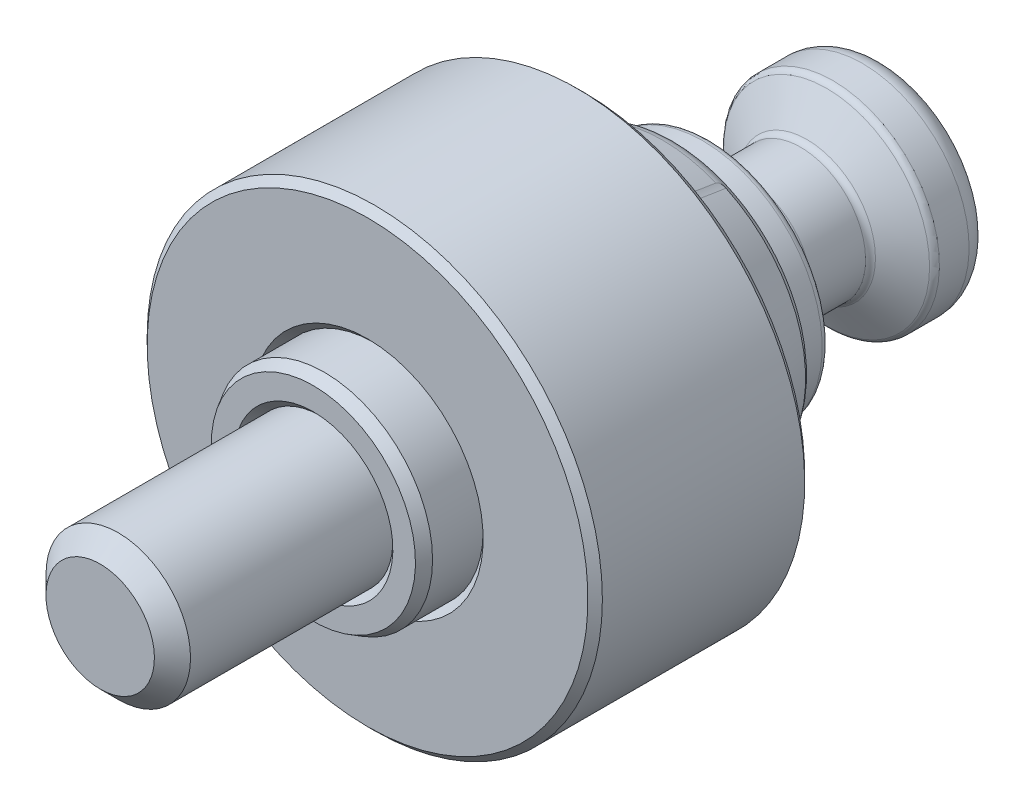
ISO-10303-21;
HEADER;
FILE_DESCRIPTION(('STEP AP214'),'2;1');
FILE_NAME('part.step','',(''),(''),'','','');
FILE_SCHEMA(('AUTOMOTIVE_DESIGN { 1 0 10303 214 1 1 1 1 }'));
ENDSEC;
DATA;
#1=APPLICATION_CONTEXT('core data for automotive mechanical design processes');
#2=APPLICATION_PROTOCOL_DEFINITION('international standard','automotive_design',2000,#1);
#3=PRODUCT_CONTEXT('',#1,'mechanical');
#4=PRODUCT('Part','Part','',(#3));
#5=PRODUCT_RELATED_PRODUCT_CATEGORY('part','',(#4));
#6=PRODUCT_DEFINITION_FORMATION('','',#4);
#7=PRODUCT_DEFINITION_CONTEXT('part definition',#1,'design');
#8=PRODUCT_DEFINITION('design','',#6,#7);
#9=PRODUCT_DEFINITION_SHAPE('','',#8);
#10=(LENGTH_UNIT() NAMED_UNIT(*) SI_UNIT(.MILLI.,.METRE.));
#11=(NAMED_UNIT(*) PLANE_ANGLE_UNIT() SI_UNIT($,.RADIAN.));
#12=(NAMED_UNIT(*) SI_UNIT($,.STERADIAN.) SOLID_ANGLE_UNIT());
#13=UNCERTAINTY_MEASURE_WITH_UNIT(LENGTH_MEASURE(1.E-05),#10,'distance_accuracy_value','');
#14=(GEOMETRIC_REPRESENTATION_CONTEXT(3) GLOBAL_UNCERTAINTY_ASSIGNED_CONTEXT((#13)) GLOBAL_UNIT_ASSIGNED_CONTEXT((#10,
#11,#12)) REPRESENTATION_CONTEXT('',''));
#15=CARTESIAN_POINT('',(0.,0.,0.));
#16=DIRECTION('',(0.,0.,1.));
#17=DIRECTION('',(1.,0.,0.));
#18=AXIS2_PLACEMENT_3D('',#15,#16,#17);
#19=CARTESIAN_POINT('',(0.,0.,0.136799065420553));
#20=DIRECTION('',(0.,0.,-1.));
#21=DIRECTION('',(0.,-1.,0.));
#22=AXIS2_PLACEMENT_3D('',#19,#20,#21);
#23=CYLINDRICAL_SURFACE('',#22,31.5);
#24=CARTESIAN_POINT('',(0.,0.,14.));
#25=DIRECTION('',(0.,0.,-1.));
#26=DIRECTION('',(0.,-1.,0.));
#27=AXIS2_PLACEMENT_3D('',#24,#25,#26);
#28=CIRCLE('',#27,31.5);
#29=CARTESIAN_POINT('',(0.,-31.5,14.));
#30=VERTEX_POINT('',#29);
#31=EDGE_CURVE('E30',#30,#30,#28,.F.);
#32=ORIENTED_EDGE('',*,*,#31,.T.);
#33=EDGE_LOOP('',(#32));
#34=FACE_BOUND('',#33,.T.);
#35=CARTESIAN_POINT('',(0.,0.,42.));
#36=DIRECTION('',(0.,0.,1.));
#37=DIRECTION('',(0.,1.,0.));
#38=AXIS2_PLACEMENT_3D('',#35,#36,#37);
#39=CIRCLE('',#38,31.5);
#40=CARTESIAN_POINT('',(0.,31.5,42.));
#41=VERTEX_POINT('',#40);
#42=EDGE_CURVE('E425',#41,#41,#39,.F.);
#43=ORIENTED_EDGE('',*,*,#42,.T.);
#44=EDGE_LOOP('',(#43));
#45=FACE_BOUND('',#44,.T.);
#46=ADVANCED_FACE('F14',(#34,#45),#23,.T.);
#47=CARTESIAN_POINT('',(0.,0.,13.));
#48=DIRECTION('',(0.,0.,1.));
#49=DIRECTION('',(0.,1.,0.));
#50=AXIS2_PLACEMENT_3D('',#47,#48,#49);
#51=CONICAL_SURFACE('',#50,30.5,0.785398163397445);
#52=ORIENTED_EDGE('',*,*,#31,.F.);
#53=EDGE_LOOP('',(#52));
#54=FACE_BOUND('',#53,.T.);
#55=CARTESIAN_POINT('',(0.,0.,13.));
#56=DIRECTION('',(0.,0.,-1.));
#57=DIRECTION('',(0.,-1.,0.));
#58=AXIS2_PLACEMENT_3D('',#55,#56,#57);
#59=CIRCLE('',#58,30.5);
#60=CARTESIAN_POINT('',(0.,-30.5,13.));
#61=VERTEX_POINT('',#60);
#62=EDGE_CURVE('E421',#61,#61,#59,.T.);
#63=ORIENTED_EDGE('',*,*,#62,.F.);
#64=EDGE_LOOP('',(#63));
#65=FACE_BOUND('',#64,.T.);
#66=ADVANCED_FACE('F528',(#54,#65),#51,.T.);
#67=CARTESIAN_POINT('',(-15.,0.,13.));
#68=DIRECTION('',(0.,0.,-1.));
#69=DIRECTION('',(0.,-1.,0.));
#70=AXIS2_PLACEMENT_3D('',#67,#68,#69);
#71=PLANE('',#70);
#72=ORIENTED_EDGE('',*,*,#62,.T.);
#73=EDGE_LOOP('',(#72));
#74=FACE_BOUND('',#73,.T.);
#75=CARTESIAN_POINT('',(0.,0.,13.));
#76=DIRECTION('',(0.,0.,1.));
#77=DIRECTION('',(0.,1.,0.));
#78=AXIS2_PLACEMENT_3D('',#75,#76,#77);
#79=CIRCLE('',#78,21.9);
#80=CARTESIAN_POINT('',(0.,21.9,13.));
#81=VERTEX_POINT('',#80);
#82=EDGE_CURVE('E9',#81,#81,#79,.T.);
#83=ORIENTED_EDGE('',*,*,#82,.T.);
#84=EDGE_LOOP('',(#83));
#85=FACE_BOUND('',#84,.T.);
#86=ADVANCED_FACE('F539',(#74,#85),#71,.T.);
#87=CARTESIAN_POINT('',(0.,0.,42.));
#88=DIRECTION('',(0.,0.,-1.));
#89=DIRECTION('',(0.,-1.,0.));
#90=AXIS2_PLACEMENT_3D('',#87,#88,#89);
#91=CONICAL_SURFACE('',#90,31.5,0.785398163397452);
#92=CARTESIAN_POINT('',(0.,0.,43.));
#93=DIRECTION('',(0.,0.,1.));
#94=DIRECTION('',(0.,1.,0.));
#95=AXIS2_PLACEMENT_3D('',#92,#93,#94);
#96=CIRCLE('',#95,30.5);
#97=CARTESIAN_POINT('',(0.,30.5,43.));
#98=VERTEX_POINT('',#97);
#99=EDGE_CURVE('E315',#98,#98,#96,.T.);
#100=ORIENTED_EDGE('',*,*,#99,.F.);
#101=EDGE_LOOP('',(#100));
#102=FACE_BOUND('',#101,.T.);
#103=ORIENTED_EDGE('',*,*,#42,.F.);
#104=EDGE_LOOP('',(#103));
#105=FACE_BOUND('',#104,.T.);
#106=ADVANCED_FACE('F551',(#102,#105),#91,.T.);
#107=CARTESIAN_POINT('',(-15.,0.,43.));
#108=DIRECTION('',(0.,0.,1.));
#109=DIRECTION('',(0.,1.,0.));
#110=AXIS2_PLACEMENT_3D('',#107,#108,#109);
#111=PLANE('',#110);
#112=CARTESIAN_POINT('',(0.,0.,43.));
#113=DIRECTION('',(0.,0.,1.));
#114=DIRECTION('',(0.,1.,0.));
#115=AXIS2_PLACEMENT_3D('',#112,#113,#114);
#116=CIRCLE('',#115,16.);
#117=CARTESIAN_POINT('',(0.,16.,43.));
#118=VERTEX_POINT('',#117);
#119=EDGE_CURVE('E422',#118,#118,#116,.F.);
#120=ORIENTED_EDGE('',*,*,#119,.T.);
#121=EDGE_LOOP('',(#120));
#122=FACE_BOUND('',#121,.T.);
#123=ORIENTED_EDGE('',*,*,#99,.T.);
#124=EDGE_LOOP('',(#123));
#125=FACE_BOUND('',#124,.T.);
#126=ADVANCED_FACE('F561',(#122,#125),#111,.T.);
#127=CARTESIAN_POINT('',(0.,0.,43.));
#128=DIRECTION('',(0.,0.,1.));
#129=DIRECTION('',(0.,1.,0.));
#130=AXIS2_PLACEMENT_3D('',#127,#128,#129);
#131=CONICAL_SURFACE('',#130,16.,0.78539816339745);
#132=CARTESIAN_POINT('',(0.,0.,42.));
#133=DIRECTION('',(0.,0.,1.));
#134=DIRECTION('',(0.,1.,0.));
#135=AXIS2_PLACEMENT_3D('',#132,#133,#134);
#136=CIRCLE('',#135,15.);
#137=CARTESIAN_POINT('',(0.,15.,42.));
#138=VERTEX_POINT('',#137);
#139=EDGE_CURVE('E419',#138,#138,#136,.T.);
#140=ORIENTED_EDGE('',*,*,#139,.F.);
#141=EDGE_LOOP('',(#140));
#142=FACE_BOUND('',#141,.T.);
#143=ORIENTED_EDGE('',*,*,#119,.F.);
#144=EDGE_LOOP('',(#143));
#145=FACE_BOUND('',#144,.T.);
#146=ADVANCED_FACE('F520',(#142,#145),#131,.F.);
#147=CARTESIAN_POINT('',(0.,0.,80.));
#148=DIRECTION('',(0.,0.,1.));
#149=DIRECTION('',(0.,-1.,0.));
#150=AXIS2_PLACEMENT_3D('',#147,#148,#149);
#151=PLANE('',#150);
#152=CARTESIAN_POINT('',(0.,0.,80.));
#153=DIRECTION('',(0.,0.,1.));
#154=DIRECTION('',(0.,-1.,0.));
#155=AXIS2_PLACEMENT_3D('',#152,#153,#154);
#156=CIRCLE('',#155,7.5);
#157=CARTESIAN_POINT('',(0.,-7.5,80.));
#158=VERTEX_POINT('',#157);
#159=EDGE_CURVE('E769',#158,#158,#156,.T.);
#160=ORIENTED_EDGE('',*,*,#159,.T.);
#161=EDGE_LOOP('',(#160));
#162=FACE_BOUND('',#161,.T.);
#163=ADVANCED_FACE('F404',(#162),#151,.T.);
#164=CARTESIAN_POINT('',(0.,0.,77.5));
#165=DIRECTION('',(0.,0.,-1.));
#166=DIRECTION('',(0.,1.,0.));
#167=AXIS2_PLACEMENT_3D('',#164,#165,#166);
#168=CONICAL_SURFACE('',#167,10.,0.785398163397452);
#169=ORIENTED_EDGE('',*,*,#159,.F.);
#170=EDGE_LOOP('',(#169));
#171=FACE_BOUND('',#170,.T.);
#172=CARTESIAN_POINT('',(0.,0.,77.5));
#173=DIRECTION('',(0.,0.,1.));
#174=DIRECTION('',(0.,-1.,0.));
#175=AXIS2_PLACEMENT_3D('',#172,#173,#174);
#176=CIRCLE('',#175,10.);
#177=CARTESIAN_POINT('',(0.,-10.,77.5));
#178=VERTEX_POINT('',#177);
#179=EDGE_CURVE('E772',#178,#178,#176,.F.);
#180=ORIENTED_EDGE('',*,*,#179,.F.);
#181=EDGE_LOOP('',(#180));
#182=FACE_BOUND('',#181,.T.);
#183=ADVANCED_FACE('F401',(#171,#182),#168,.T.);
#184=CARTESIAN_POINT('',(0.,0.,0.));
#185=DIRECTION('',(0.,0.,-1.));
#186=DIRECTION('',(0.,1.,0.));
#187=AXIS2_PLACEMENT_3D('',#184,#185,#186);
#188=CYLINDRICAL_SURFACE('',#187,10.);
#189=ORIENTED_EDGE('',*,*,#179,.T.);
#190=EDGE_LOOP('',(#189));
#191=FACE_BOUND('',#190,.T.);
#192=CARTESIAN_POINT('',(0.,0.,49.5));
#193=DIRECTION('',(0.,0.,1.));
#194=DIRECTION('',(0.,1.,0.));
#195=AXIS2_PLACEMENT_3D('',#192,#193,#194);
#196=CIRCLE('',#195,10.);
#197=CARTESIAN_POINT('',(0.,10.,49.5));
#198=VERTEX_POINT('',#197);
#199=EDGE_CURVE('E303',#198,#198,#196,.T.);
#200=ORIENTED_EDGE('',*,*,#199,.T.);
#201=EDGE_LOOP('',(#200));
#202=FACE_BOUND('',#201,.T.);
#203=ADVANCED_FACE('F393',(#191,#202),#188,.T.);
#204=CARTESIAN_POINT('',(0.,0.,50.5));
#205=DIRECTION('',(0.,0.,1.));
#206=DIRECTION('',(0.,1.,0.));
#207=AXIS2_PLACEMENT_3D('',#204,#205,#206);
#208=CONICAL_SURFACE('',#207,11.,0.785398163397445);
#209=ORIENTED_EDGE('',*,*,#199,.F.);
#210=EDGE_LOOP('',(#209));
#211=FACE_BOUND('',#210,.T.);
#212=CARTESIAN_POINT('',(0.,0.,50.5));
#213=DIRECTION('',(0.,0.,1.));
#214=DIRECTION('',(0.,1.,0.));
#215=AXIS2_PLACEMENT_3D('',#212,#213,#214);
#216=CIRCLE('',#215,11.);
#217=CARTESIAN_POINT('',(0.,11.,50.5));
#218=VERTEX_POINT('',#217);
#219=EDGE_CURVE('E300',#218,#218,#216,.F.);
#220=ORIENTED_EDGE('',*,*,#219,.F.);
#221=EDGE_LOOP('',(#220));
#222=FACE_BOUND('',#221,.T.);
#223=ADVANCED_FACE('F390',(#211,#222),#208,.F.);
#224=CARTESIAN_POINT('',(-10.,0.,50.5));
#225=DIRECTION('',(0.,0.,1.));
#226=DIRECTION('',(0.,1.,0.));
#227=AXIS2_PLACEMENT_3D('',#224,#225,#226);
#228=PLANE('',#227);
#229=ORIENTED_EDGE('',*,*,#219,.T.);
#230=EDGE_LOOP('',(#229));
#231=FACE_BOUND('',#230,.T.);
#232=CARTESIAN_POINT('',(0.,0.,50.5));
#233=DIRECTION('',(0.,0.,1.));
#234=DIRECTION('',(0.,1.,0.));
#235=AXIS2_PLACEMENT_3D('',#232,#233,#234);
#236=CIRCLE('',#235,14.1339745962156);
#237=CARTESIAN_POINT('',(0.,14.1339745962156,50.5));
#238=VERTEX_POINT('',#237);
#239=EDGE_CURVE('E297',#238,#238,#236,.T.);
#240=ORIENTED_EDGE('',*,*,#239,.T.);
#241=EDGE_LOOP('',(#240));
#242=FACE_BOUND('',#241,.T.);
#243=ADVANCED_FACE('F392',(#231,#242),#228,.T.);
#244=CARTESIAN_POINT('',(0.,0.,49.));
#245=DIRECTION('',(0.,0.,-1.));
#246=DIRECTION('',(0.,-1.,0.));
#247=AXIS2_PLACEMENT_3D('',#244,#245,#246);
#248=CONICAL_SURFACE('',#247,15.,0.523598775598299);
#249=ORIENTED_EDGE('',*,*,#239,.F.);
#250=EDGE_LOOP('',(#249));
#251=FACE_BOUND('',#250,.T.);
#252=CARTESIAN_POINT('',(0.,0.,49.));
#253=DIRECTION('',(0.,0.,1.));
#254=DIRECTION('',(0.,1.,0.));
#255=AXIS2_PLACEMENT_3D('',#252,#253,#254);
#256=CIRCLE('',#255,15.);
#257=CARTESIAN_POINT('',(0.,15.,49.));
#258=VERTEX_POINT('',#257);
#259=EDGE_CURVE('E294',#258,#258,#256,.F.);
#260=ORIENTED_EDGE('',*,*,#259,.F.);
#261=EDGE_LOOP('',(#260));
#262=FACE_BOUND('',#261,.T.);
#263=ADVANCED_FACE('F207',(#251,#262),#248,.T.);
#264=CARTESIAN_POINT('',(0.,0.,13.));
#265=DIRECTION('',(0.,0.,-1.));
#266=DIRECTION('',(0.,-1.,0.));
#267=AXIS2_PLACEMENT_3D('',#264,#265,#266);
#268=CYLINDRICAL_SURFACE('',#267,15.);
#269=ORIENTED_EDGE('',*,*,#259,.T.);
#270=EDGE_LOOP('',(#269));
#271=FACE_BOUND('',#270,.T.);
#272=ORIENTED_EDGE('',*,*,#139,.T.);
#273=EDGE_LOOP('',(#272));
#274=FACE_BOUND('',#273,.T.);
#275=ADVANCED_FACE('F206',(#271,#274),#268,.T.);
#276=CARTESIAN_POINT('',(0.,0.,-23.));
#277=DIRECTION('',(0.,0.,-1.));
#278=DIRECTION('',(0.,1.,0.));
#279=AXIS2_PLACEMENT_3D('',#276,#277,#278);
#280=PLANE('',#279);
#281=DIRECTION('',(0.5,0.866025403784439,0.));
#282=VECTOR('',#281,1.);
#283=CARTESIAN_POINT('',(-4.61880215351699,0.,-23.));
#284=LINE('',#283,#282);
#285=CARTESIAN_POINT('',(-4.61880215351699,0.,-23.));
#286=VERTEX_POINT('',#285);
#287=CARTESIAN_POINT('',(-2.30940107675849,4.,-23.));
#288=VERTEX_POINT('',#287);
#289=EDGE_CURVE('E818',#286,#288,#284,.T.);
#290=ORIENTED_EDGE('',*,*,#289,.T.);
#291=DIRECTION('',(1.,0.,0.));
#292=VECTOR('',#291,1.);
#293=CARTESIAN_POINT('',(-2.30940107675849,4.,-23.));
#294=LINE('',#293,#292);
#295=CARTESIAN_POINT('',(2.30940107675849,4.,-23.));
#296=VERTEX_POINT('',#295);
#297=EDGE_CURVE('E804',#288,#296,#294,.T.);
#298=ORIENTED_EDGE('',*,*,#297,.T.);
#299=DIRECTION('',(0.5,-0.866025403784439,0.));
#300=VECTOR('',#299,1.);
#301=CARTESIAN_POINT('',(2.30940107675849,4.,-23.));
#302=LINE('',#301,#300);
#303=CARTESIAN_POINT('',(4.61880215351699,0.,-23.));
#304=VERTEX_POINT('',#303);
#305=EDGE_CURVE('E81',#296,#304,#302,.T.);
#306=ORIENTED_EDGE('',*,*,#305,.T.);
#307=DIRECTION('',(-0.5,-0.866025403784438,0.));
#308=VECTOR('',#307,1.);
#309=CARTESIAN_POINT('',(4.61880215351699,0.,-23.));
#310=LINE('',#309,#308);
#311=CARTESIAN_POINT('',(2.30940107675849,-4.,-23.));
#312=VERTEX_POINT('',#311);
#313=EDGE_CURVE('E827',#304,#312,#310,.T.);
#314=ORIENTED_EDGE('',*,*,#313,.T.);
#315=DIRECTION('',(-1.,0.,0.));
#316=VECTOR('',#315,1.);
#317=CARTESIAN_POINT('',(2.30940107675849,-4.,-23.));
#318=LINE('',#317,#316);
#319=CARTESIAN_POINT('',(-2.3094010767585,-4.,-23.));
#320=VERTEX_POINT('',#319);
#321=EDGE_CURVE('E824',#312,#320,#318,.T.);
#322=ORIENTED_EDGE('',*,*,#321,.T.);
#323=DIRECTION('',(-0.5,0.866025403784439,0.));
#324=VECTOR('',#323,1.);
#325=CARTESIAN_POINT('',(-2.3094010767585,-4.,-23.));
#326=LINE('',#325,#324);
#327=EDGE_CURVE('E821',#320,#286,#326,.T.);
#328=ORIENTED_EDGE('',*,*,#327,.T.);
#329=EDGE_LOOP('',(#290,#298,#306,#314,#322,#328));
#330=FACE_BOUND('',#329,.T.);
#331=ADVANCED_FACE('F342',(#330),#280,.T.);
#332=CARTESIAN_POINT('',(4.61880215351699,0.,-23.));
#333=DIRECTION('',(0.866025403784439,-0.5,0.));
#334=DIRECTION('',(0.5,0.866025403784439,0.));
#335=AXIS2_PLACEMENT_3D('',#332,#333,#334);
#336=PLANE('',#335);
#337=CARTESIAN_POINT('',(2.30928560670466,-4.0002,-28.2799819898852));
#338=CARTESIAN_POINT('',(2.41077174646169,-3.82442084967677,-28.2213676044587));
#339=CARTESIAN_POINT('',(2.51313390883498,-3.64712438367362,-28.1680600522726));
#340=CARTESIAN_POINT('',(2.7196307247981,-3.28946140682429,-28.0750114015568));
#341=CARTESIAN_POINT('',(2.82376904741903,-3.10908854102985,-28.0353032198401));
#342=CARTESIAN_POINT('',(3.03075510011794,-2.75057818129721,-27.9734919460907));
#343=CARTESIAN_POINT('',(3.1335709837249,-2.57249584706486,-27.9509774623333));
#344=CARTESIAN_POINT('',(3.33968651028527,-2.21549328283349,-27.9241003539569));
#345=CARTESIAN_POINT('',(3.44298540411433,-2.0365743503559,-27.9197154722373));
#346=CARTESIAN_POINT('',(3.63600352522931,-1.70225715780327,-27.9288398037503));
#347=CARTESIAN_POINT('',(3.72575165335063,-1.54680884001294,-27.9401086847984));
#348=CARTESIAN_POINT('',(3.90466320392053,-1.23692494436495,-27.9758237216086));
#349=CARTESIAN_POINT('',(3.99382600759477,-1.08249043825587,-28.0002820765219));
#350=CARTESIAN_POINT('',(4.17310641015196,-0.771967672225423,-28.0614257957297));
#351=CARTESIAN_POINT('',(4.2632013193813,-0.615918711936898,-28.0983703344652));
#352=CARTESIAN_POINT('',(4.44204742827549,-0.306148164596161,-28.1822198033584));
#353=CARTESIAN_POINT('',(4.53080091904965,-0.152422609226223,-28.2291050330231));
#354=CARTESIAN_POINT('',(4.61891762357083,0.000199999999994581,-28.2799819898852));
#355=B_SPLINE_CURVE_WITH_KNOTS('',3,(#337,#338,#339,#340,#341,#342,#343,#344,#345,#346,#347,
#348,#349,#350,#351,#352,#353,#354),.UNSPECIFIED.,.F.,.F.,(4,2,2,2,2,2,2,2,4),(0.,
0.634047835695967,1.26961969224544,1.88946157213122,2.50854226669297,3.04757825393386,
3.58711366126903,4.13861653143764,4.68903648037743),.UNSPECIFIED.);
#356=CARTESIAN_POINT('',(2.30940107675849,-4.,-28.2799153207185));
#357=VERTEX_POINT('',#356);
#358=CARTESIAN_POINT('',(4.61880215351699,0.,-28.2799153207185));
#359=VERTEX_POINT('',#358);
#360=EDGE_CURVE('E18',#357,#359,#355,.T.);
#361=ORIENTED_EDGE('',*,*,#360,.F.);
#362=DIRECTION('',(0.,0.,-1.));
#363=VECTOR('',#362,1.);
#364=CARTESIAN_POINT('',(2.30940107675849,-4.,-23.));
#365=LINE('',#364,#363);
#366=EDGE_CURVE('E803',#312,#357,#365,.T.);
#367=ORIENTED_EDGE('',*,*,#366,.F.);
#368=ORIENTED_EDGE('',*,*,#313,.F.);
#369=DIRECTION('',(0.,0.,-1.));
#370=VECTOR('',#369,1.);
#371=CARTESIAN_POINT('',(4.61880215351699,0.,-23.));
#372=LINE('',#371,#370);
#373=EDGE_CURVE('E800',#304,#359,#372,.T.);
#374=ORIENTED_EDGE('',*,*,#373,.T.);
#375=EDGE_LOOP('',(#361,#367,#368,#374));
#376=FACE_BOUND('',#375,.T.);
#377=ADVANCED_FACE('F387',(#376),#336,.F.);
#378=CARTESIAN_POINT('',(2.30940107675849,-4.,-23.));
#379=DIRECTION('',(0.,-1.,0.));
#380=DIRECTION('',(1.,0.,0.));
#381=AXIS2_PLACEMENT_3D('',#378,#379,#380);
#382=PLANE('',#381);
#383=CARTESIAN_POINT('',(-6.11536351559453,-4.,-29.8321612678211));
#384=CARTESIAN_POINT('',(-5.94136455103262,-4.,-29.7481138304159));
#385=CARTESIAN_POINT('',(-5.76695654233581,-4.,-29.6648982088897));
#386=CARTESIAN_POINT('',(-5.41710453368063,-4.,-29.5006003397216));
#387=CARTESIAN_POINT('',(-5.24166036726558,-4.,-29.4195184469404));
#388=CARTESIAN_POINT('',(-4.88857129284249,-4.,-29.2595308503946));
#389=CARTESIAN_POINT('',(-4.71091953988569,-4.,-29.1806401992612));
#390=CARTESIAN_POINT('',(-4.35417172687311,-4.,-29.0262076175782));
#391=CARTESIAN_POINT('',(-4.17507573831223,-4.,-28.9506655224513));
#392=CARTESIAN_POINT('',(-3.80974659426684,-4.,-28.8016107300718));
#393=CARTESIAN_POINT('',(-3.623460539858,-4.,-28.7282269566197));
#394=CARTESIAN_POINT('',(-3.24867678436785,-4.,-28.5872295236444));
#395=CARTESIAN_POINT('',(-3.06017883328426,-4.,-28.5196165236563));
#396=CARTESIAN_POINT('',(-2.68105362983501,-4.,-28.3920002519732));
#397=CARTESIAN_POINT('',(-2.49043188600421,-4.,-28.3319807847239));
#398=CARTESIAN_POINT('',(-2.1064563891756,-4.,-28.2215351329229));
#399=CARTESIAN_POINT('',(-1.91310354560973,-4.,-28.1711058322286));
#400=CARTESIAN_POINT('',(-1.52459990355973,-4.,-28.0825776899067));
#401=CARTESIAN_POINT('',(-1.32946366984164,-4.,-28.0444161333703));
#402=CARTESIAN_POINT('',(-0.936859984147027,-4.,-27.9826444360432));
#403=CARTESIAN_POINT('',(-0.739392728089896,-4.,-27.9590330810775));
#404=CARTESIAN_POINT('',(-0.345654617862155,-4.,-27.9285556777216));
#405=CARTESIAN_POINT('',(-0.149400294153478,-4.,-27.9214813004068));
#406=CARTESIAN_POINT('',(0.243008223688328,-4.,-27.9241343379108));
#407=CARTESIAN_POINT('',(0.439162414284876,-4.,-27.9338623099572));
#408=CARTESIAN_POINT('',(0.774833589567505,-4.,-27.9642118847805));
#409=CARTESIAN_POINT('',(0.914717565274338,-4.,-27.9809861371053));
#410=CARTESIAN_POINT('',(1.19339686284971,-4.,-28.0219863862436));
#411=CARTESIAN_POINT('',(1.33219202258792,-4.,-28.0462134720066));
#412=CARTESIAN_POINT('',(1.74679493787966,-4.,-28.1287935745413));
#413=CARTESIAN_POINT('',(2.02065290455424,-4.,-28.1970283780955));
#414=CARTESIAN_POINT('',(2.43006674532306,-4.,-28.314532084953));
#415=CARTESIAN_POINT('',(2.56776398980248,-4.,-28.3567577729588));
#416=CARTESIAN_POINT('',(2.84181962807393,-4.,-28.4453888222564));
#417=CARTESIAN_POINT('',(2.978178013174,-4.,-28.4917942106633));
#418=CARTESIAN_POINT('',(3.24960349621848,-4.,-28.5880571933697));
#419=CARTESIAN_POINT('',(3.38467104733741,-4.,-28.6379135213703));
#420=CARTESIAN_POINT('',(3.65370081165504,-4.,-28.740512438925));
#421=CARTESIAN_POINT('',(3.78766303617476,-4.,-28.7932549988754));
#422=CARTESIAN_POINT('',(4.09701986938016,-4.,-28.9182840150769));
#423=CARTESIAN_POINT('',(4.27205588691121,-4.,-28.991455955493));
#424=CARTESIAN_POINT('',(4.62071132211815,-4.,-29.141108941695));
#425=CARTESIAN_POINT('',(4.79433066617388,-4.,-29.2175901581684));
#426=CARTESIAN_POINT('',(5.14040670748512,-4.,-29.373213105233));
#427=CARTESIAN_POINT('',(5.31286319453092,-4.,-29.4523553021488));
#428=CARTESIAN_POINT('',(5.65677659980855,-4.,-29.6127855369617));
#429=CARTESIAN_POINT('',(5.82823349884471,-4.,-29.6940736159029));
#430=CARTESIAN_POINT('',(6.34165551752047,-4.,-29.9406928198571));
#431=CARTESIAN_POINT('',(6.68236404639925,-4.,-30.1086386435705));
#432=CARTESIAN_POINT('',(7.36139047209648,-4.,-30.4492937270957));
#433=CARTESIAN_POINT('',(7.69970828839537,-4.,-30.6220031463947));
#434=CARTESIAN_POINT('',(8.34749653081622,-4.,-30.9568309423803));
#435=CARTESIAN_POINT('',(8.65710289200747,-4.,-31.1186868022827));
#436=CARTESIAN_POINT('',(9.27517825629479,-4.,-31.4445752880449));
#437=CARTESIAN_POINT('',(9.58364722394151,-4.,-31.6086079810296));
#438=CARTESIAN_POINT('',(10.1989977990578,-4.,-31.937968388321));
#439=CARTESIAN_POINT('',(10.5058814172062,-4.,-32.1032923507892));
#440=CARTESIAN_POINT('',(11.11891782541,-4.,-32.4352539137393));
#441=CARTESIAN_POINT('',(11.4250706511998,-4.,-32.6018914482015));
#442=CARTESIAN_POINT('',(11.7309525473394,-4.,-32.7690213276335));
#443=B_SPLINE_CURVE_WITH_KNOTS('',3,(#383,#384,#385,#386,#387,#388,#389,#390,#391,#392,#393,
#394,#395,#396,#397,#398,#399,#400,#401,#402,#403,#404,#405,#406,#407,#408,#409,#410,#411,#412,
#413,#414,#415,#416,#417,#418,#419,#420,#421,#422,#423,#424,#425,#426,#427,#428,#429,#430,#431,
#432,#433,#434,#435,#436,#437,#438,#439,#440,#441,#442),.UNSPECIFIED.,.F.,.F.,(4,2,2,2,2,2,2,2,
2,2,2,2,2,2,2,2,2,2,2,2,2,2,2,2,2,2,2,2,2,4),(0.,0.579711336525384,1.15951848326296,
1.74263314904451,2.3257191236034,2.92630247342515,3.52695437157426,4.12630278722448,
4.72545612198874,5.32149588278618,5.91748589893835,6.50592633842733,7.09438629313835,
7.51683805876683,7.93935157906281,8.78488063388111,9.21692534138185,9.64897285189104,
10.0808626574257,10.512748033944,11.0818474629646,11.6509762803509,12.220205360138,
12.7894453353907,13.9289401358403,15.0684731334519,16.1165460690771,17.1646513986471,
18.2103945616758,19.2560854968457),.UNSPECIFIED.);
#444=CARTESIAN_POINT('',(-2.3094010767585,-4.,-28.2799153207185));
#445=VERTEX_POINT('',#444);
#446=EDGE_CURVE('E87',#445,#357,#443,.T.);
#447=ORIENTED_EDGE('',*,*,#446,.F.);
#448=DIRECTION('',(0.,0.,-1.));
#449=VECTOR('',#448,1.);
#450=CARTESIAN_POINT('',(-2.3094010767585,-4.,-23.));
#451=LINE('',#450,#449);
#452=EDGE_CURVE('E807',#320,#445,#451,.T.);
#453=ORIENTED_EDGE('',*,*,#452,.F.);
#454=ORIENTED_EDGE('',*,*,#321,.F.);
#455=ORIENTED_EDGE('',*,*,#366,.T.);
#456=EDGE_LOOP('',(#447,#453,#454,#455));
#457=FACE_BOUND('',#456,.T.);
#458=ADVANCED_FACE('F332',(#457),#382,.F.);
#459=CARTESIAN_POINT('',(-2.3094010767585,-4.,-23.));
#460=DIRECTION('',(-0.866025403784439,-0.5,0.));
#461=DIRECTION('',(0.5,-0.866025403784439,0.));
#462=AXIS2_PLACEMENT_3D('',#459,#460,#461);
#463=PLANE('',#462);
#464=CARTESIAN_POINT('',(-4.61891762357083,0.000200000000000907,-28.2799819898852));
#465=CARTESIAN_POINT('',(-4.5174314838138,-0.175579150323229,-28.2213676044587));
#466=CARTESIAN_POINT('',(-4.41506932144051,-0.352875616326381,-28.1680600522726));
#467=CARTESIAN_POINT('',(-4.20857250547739,-0.710538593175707,-28.0750114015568));
#468=CARTESIAN_POINT('',(-4.10443418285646,-0.890911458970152,-28.0353032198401));
#469=CARTESIAN_POINT('',(-3.89744813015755,-1.24942181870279,-27.9734919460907));
#470=CARTESIAN_POINT('',(-3.79463224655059,-1.42750415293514,-27.9509774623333));
#471=CARTESIAN_POINT('',(-3.58851671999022,-1.78450671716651,-27.9241003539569));
#472=CARTESIAN_POINT('',(-3.48521782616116,-1.9634256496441,-27.9197154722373));
#473=CARTESIAN_POINT('',(-3.29219970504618,-2.29774284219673,-27.9288398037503));
#474=CARTESIAN_POINT('',(-3.20245157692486,-2.45319115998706,-27.9401086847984));
#475=CARTESIAN_POINT('',(-3.02354002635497,-2.76307505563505,-27.9758237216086));
#476=CARTESIAN_POINT('',(-2.93437722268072,-2.91750956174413,-28.0002820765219));
#477=CARTESIAN_POINT('',(-2.75509682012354,-3.22803232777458,-28.0614257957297));
#478=CARTESIAN_POINT('',(-2.6650019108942,-3.3840812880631,-28.0983703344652));
#479=CARTESIAN_POINT('',(-2.486155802,-3.69385183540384,-28.1822198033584));
#480=CARTESIAN_POINT('',(-2.39740231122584,-3.84757739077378,-28.2291050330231));
#481=CARTESIAN_POINT('',(-2.30928560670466,-4.0002,-28.2799819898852));
#482=B_SPLINE_CURVE_WITH_KNOTS('',3,(#464,#465,#466,#467,#468,#469,#470,#471,#472,#473,#474,
#475,#476,#477,#478,#479,#480,#481),.UNSPECIFIED.,.F.,.F.,(4,2,2,2,2,2,2,2,4),(0.,
0.634047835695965,1.26961969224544,1.88946157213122,2.50854226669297,3.04757825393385,
3.58711366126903,4.13861653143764,4.68903648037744),.UNSPECIFIED.);
#483=CARTESIAN_POINT('',(-4.61880215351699,0.,-28.2799153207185));
#484=VERTEX_POINT('',#483);
#485=EDGE_CURVE('E325',#484,#445,#482,.T.);
#486=ORIENTED_EDGE('',*,*,#485,.F.);
#487=DIRECTION('',(0.,0.,-1.));
#488=VECTOR('',#487,1.);
#489=CARTESIAN_POINT('',(-4.61880215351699,0.,-23.));
#490=LINE('',#489,#488);
#491=EDGE_CURVE('E810',#286,#484,#490,.T.);
#492=ORIENTED_EDGE('',*,*,#491,.F.);
#493=ORIENTED_EDGE('',*,*,#327,.F.);
#494=ORIENTED_EDGE('',*,*,#452,.T.);
#495=EDGE_LOOP('',(#486,#492,#493,#494));
#496=FACE_BOUND('',#495,.T.);
#497=ADVANCED_FACE('F377',(#496),#463,.F.);
#498=CARTESIAN_POINT('',(-4.61880215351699,0.,-23.));
#499=DIRECTION('',(-0.866025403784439,0.5,0.));
#500=DIRECTION('',(-0.5,-0.866025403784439,0.));
#501=AXIS2_PLACEMENT_3D('',#498,#499,#500);
#502=PLANE('',#501);
#503=CARTESIAN_POINT('',(-2.30928560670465,4.0002,-28.2799819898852));
#504=CARTESIAN_POINT('',(-2.41077174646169,3.82442084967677,-28.2213676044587));
#505=CARTESIAN_POINT('',(-2.51313390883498,3.64712438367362,-28.1680600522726));
#506=CARTESIAN_POINT('',(-2.7196307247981,3.28946140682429,-28.0750114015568));
#507=CARTESIAN_POINT('',(-2.82376904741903,3.10908854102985,-28.0353032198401));
#508=CARTESIAN_POINT('',(-3.03075510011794,2.75057818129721,-27.9734919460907));
#509=CARTESIAN_POINT('',(-3.1335709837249,2.57249584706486,-27.9509774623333));
#510=CARTESIAN_POINT('',(-3.33968651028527,2.21549328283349,-27.9241003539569));
#511=CARTESIAN_POINT('',(-3.44298540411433,2.0365743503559,-27.9197154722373));
#512=CARTESIAN_POINT('',(-3.63600352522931,1.70225715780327,-27.9288398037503));
#513=CARTESIAN_POINT('',(-3.72575165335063,1.54680884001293,-27.9401086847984));
#514=CARTESIAN_POINT('',(-3.90466320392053,1.23692494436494,-27.9758237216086));
#515=CARTESIAN_POINT('',(-3.99382600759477,1.08249043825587,-28.0002820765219));
#516=CARTESIAN_POINT('',(-4.17310641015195,0.77196767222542,-28.0614257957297));
#517=CARTESIAN_POINT('',(-4.2632013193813,0.615918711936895,-28.0983703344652));
#518=CARTESIAN_POINT('',(-4.44204742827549,0.306148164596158,-28.1822198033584));
#519=CARTESIAN_POINT('',(-4.53080091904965,0.152422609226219,-28.2291050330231));
#520=CARTESIAN_POINT('',(-4.61891762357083,-0.000199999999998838,-28.2799819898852));
#521=B_SPLINE_CURVE_WITH_KNOTS('',3,(#503,#504,#505,#506,#507,#508,#509,#510,#511,#512,#513,
#514,#515,#516,#517,#518,#519,#520),.UNSPECIFIED.,.F.,.F.,(4,2,2,2,2,2,2,2,4),(0.,
0.634047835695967,1.26961969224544,1.88946157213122,2.50854226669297,3.04757825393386,
3.58711366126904,4.13861653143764,4.68903648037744),.UNSPECIFIED.);
#522=CARTESIAN_POINT('',(-2.30940107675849,4.,-28.2799153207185));
#523=VERTEX_POINT('',#522);
#524=EDGE_CURVE('E351',#523,#484,#521,.T.);
#525=ORIENTED_EDGE('',*,*,#524,.F.);
#526=DIRECTION('',(0.,0.,-1.));
#527=VECTOR('',#526,1.);
#528=CARTESIAN_POINT('',(-2.30940107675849,4.,-23.));
#529=LINE('',#528,#527);
#530=EDGE_CURVE('E813',#288,#523,#529,.T.);
#531=ORIENTED_EDGE('',*,*,#530,.F.);
#532=ORIENTED_EDGE('',*,*,#289,.F.);
#533=ORIENTED_EDGE('',*,*,#491,.T.);
#534=EDGE_LOOP('',(#525,#531,#532,#533));
#535=FACE_BOUND('',#534,.T.);
#536=ADVANCED_FACE('F373',(#535),#502,.F.);
#537=CARTESIAN_POINT('',(-2.30940107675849,4.,-23.));
#538=DIRECTION('',(0.,1.,0.));
#539=DIRECTION('',(-1.,0.,0.));
#540=AXIS2_PLACEMENT_3D('',#537,#538,#539);
#541=PLANE('',#540);
#542=CARTESIAN_POINT('',(-6.11536351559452,4.,-29.8321612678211));
#543=CARTESIAN_POINT('',(-5.94136455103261,4.,-29.7481138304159));
#544=CARTESIAN_POINT('',(-5.7669565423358,4.,-29.6648982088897));
#545=CARTESIAN_POINT('',(-5.41710453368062,4.,-29.5006003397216));
#546=CARTESIAN_POINT('',(-5.24166036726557,4.,-29.4195184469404));
#547=CARTESIAN_POINT('',(-4.88857129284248,4.,-29.2595308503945));
#548=CARTESIAN_POINT('',(-4.71091953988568,4.,-29.1806401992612));
#549=CARTESIAN_POINT('',(-4.3541717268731,4.,-29.0262076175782));
#550=CARTESIAN_POINT('',(-4.17507573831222,4.,-28.9506655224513));
#551=CARTESIAN_POINT('',(-3.80974659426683,4.,-28.8016107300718));
#552=CARTESIAN_POINT('',(-3.62346053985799,4.,-28.7282269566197));
#553=CARTESIAN_POINT('',(-3.24867678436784,4.,-28.5872295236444));
#554=CARTESIAN_POINT('',(-3.06017883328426,4.,-28.5196165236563));
#555=CARTESIAN_POINT('',(-2.681053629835,4.,-28.3920002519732));
#556=CARTESIAN_POINT('',(-2.4904318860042,4.,-28.3319807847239));
#557=CARTESIAN_POINT('',(-2.1064563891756,4.,-28.2215351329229));
#558=CARTESIAN_POINT('',(-1.91310354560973,4.,-28.1711058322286));
#559=CARTESIAN_POINT('',(-1.52459990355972,4.,-28.0825776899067));
#560=CARTESIAN_POINT('',(-1.32946366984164,4.,-28.0444161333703));
#561=CARTESIAN_POINT('',(-0.936859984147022,4.,-27.9826444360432));
#562=CARTESIAN_POINT('',(-0.739392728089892,4.,-27.9590330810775));
#563=CARTESIAN_POINT('',(-0.345654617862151,4.,-27.9285556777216));
#564=CARTESIAN_POINT('',(-0.149400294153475,4.,-27.9214813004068));
#565=CARTESIAN_POINT('',(0.243008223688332,4.,-27.9241343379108));
#566=CARTESIAN_POINT('',(0.439162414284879,4.,-27.9338623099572));
#567=CARTESIAN_POINT('',(0.774833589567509,4.,-27.9642118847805));
#568=CARTESIAN_POINT('',(0.914717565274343,4.,-27.9809861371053));
#569=CARTESIAN_POINT('',(1.19339686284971,4.,-28.0219863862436));
#570=CARTESIAN_POINT('',(1.33219202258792,4.,-28.0462134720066));
#571=CARTESIAN_POINT('',(1.74679493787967,4.,-28.1287935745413));
#572=CARTESIAN_POINT('',(2.02065290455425,4.,-28.1970283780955));
#573=CARTESIAN_POINT('',(2.43006674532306,4.,-28.314532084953));
#574=CARTESIAN_POINT('',(2.56776398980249,4.,-28.3567577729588));
#575=CARTESIAN_POINT('',(2.84181962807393,4.,-28.4453888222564));
#576=CARTESIAN_POINT('',(2.97817801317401,4.,-28.4917942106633));
#577=CARTESIAN_POINT('',(3.24960349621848,4.,-28.5880571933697));
#578=CARTESIAN_POINT('',(3.38467104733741,4.,-28.6379135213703));
#579=CARTESIAN_POINT('',(3.65370081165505,4.,-28.740512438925));
#580=CARTESIAN_POINT('',(3.78766303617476,4.,-28.7932549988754));
#581=CARTESIAN_POINT('',(4.09701986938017,4.,-28.9182840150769));
#582=CARTESIAN_POINT('',(4.27205588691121,4.,-28.991455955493));
#583=CARTESIAN_POINT('',(4.62071132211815,4.,-29.141108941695));
#584=CARTESIAN_POINT('',(4.79433066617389,4.,-29.2175901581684));
#585=CARTESIAN_POINT('',(5.14040670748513,4.,-29.373213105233));
#586=CARTESIAN_POINT('',(5.31286319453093,4.,-29.4523553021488));
#587=CARTESIAN_POINT('',(5.65677659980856,4.,-29.6127855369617));
#588=CARTESIAN_POINT('',(5.82823349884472,4.,-29.6940736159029));
#589=CARTESIAN_POINT('',(6.34165551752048,4.,-29.9406928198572));
#590=CARTESIAN_POINT('',(6.68236404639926,4.,-30.1086386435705));
#591=CARTESIAN_POINT('',(7.36139047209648,4.,-30.4492937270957));
#592=CARTESIAN_POINT('',(7.69970828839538,4.,-30.6220031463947));
#593=CARTESIAN_POINT('',(8.34749653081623,4.,-30.9568309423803));
#594=CARTESIAN_POINT('',(8.65710289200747,4.,-31.1186868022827));
#595=CARTESIAN_POINT('',(9.27517825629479,4.,-31.4445752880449));
#596=CARTESIAN_POINT('',(9.58364722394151,4.,-31.6086079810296));
#597=CARTESIAN_POINT('',(10.1989977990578,4.,-31.937968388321));
#598=CARTESIAN_POINT('',(10.5058814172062,3.99999999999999,-32.1032923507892));
#599=CARTESIAN_POINT('',(11.11891782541,3.99999999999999,-32.4352539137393));
#600=CARTESIAN_POINT('',(11.4250706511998,4.,-32.6018914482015));
#601=CARTESIAN_POINT('',(11.7309525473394,4.,-32.7690213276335));
#602=B_SPLINE_CURVE_WITH_KNOTS('',3,(#542,#543,#544,#545,#546,#547,#548,#549,#550,#551,#552,
#553,#554,#555,#556,#557,#558,#559,#560,#561,#562,#563,#564,#565,#566,#567,#568,#569,#570,#571,
#572,#573,#574,#575,#576,#577,#578,#579,#580,#581,#582,#583,#584,#585,#586,#587,#588,#589,#590,
#591,#592,#593,#594,#595,#596,#597,#598,#599,#600,#601),.UNSPECIFIED.,.F.,.F.,(4,2,2,2,2,2,2,2,
2,2,2,2,2,2,2,2,2,2,2,2,2,2,2,2,2,2,2,2,2,4),(0.,0.579711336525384,1.15951848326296,
1.74263314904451,2.3257191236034,2.92630247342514,3.52695437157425,4.12630278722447,
4.72545612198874,5.32149588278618,5.91748589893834,6.50592633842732,7.09438629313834,
7.51683805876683,7.93935157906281,8.78488063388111,9.21692534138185,9.64897285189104,
10.0808626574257,10.512748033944,11.0818474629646,11.6509762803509,12.220205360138,
12.7894453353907,13.9289401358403,15.0684731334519,16.1165460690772,17.1646513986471,
18.2103945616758,19.2560854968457),.UNSPECIFIED.);
#603=CARTESIAN_POINT('',(2.30940107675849,4.,-28.2799153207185));
#604=VERTEX_POINT('',#603);
#605=EDGE_CURVE('E358',#604,#523,#602,.F.);
#606=ORIENTED_EDGE('',*,*,#605,.F.);
#607=DIRECTION('',(0.,0.,-1.));
#608=VECTOR('',#607,1.);
#609=CARTESIAN_POINT('',(2.30940107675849,4.,-23.));
#610=LINE('',#609,#608);
#611=EDGE_CURVE('E799',#296,#604,#610,.T.);
#612=ORIENTED_EDGE('',*,*,#611,.F.);
#613=ORIENTED_EDGE('',*,*,#297,.F.);
#614=ORIENTED_EDGE('',*,*,#530,.T.);
#615=EDGE_LOOP('',(#606,#612,#613,#614));
#616=FACE_BOUND('',#615,.T.);
#617=ADVANCED_FACE('F370',(#616),#541,.F.);
#618=CARTESIAN_POINT('',(2.30940107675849,4.,-23.));
#619=DIRECTION('',(0.866025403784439,0.5,0.));
#620=DIRECTION('',(-0.5,0.866025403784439,0.));
#621=AXIS2_PLACEMENT_3D('',#618,#619,#620);
#622=PLANE('',#621);
#623=CARTESIAN_POINT('',(4.61891762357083,-0.000200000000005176,-28.2799819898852));
#624=CARTESIAN_POINT('',(4.5174314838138,0.175579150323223,-28.2213676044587));
#625=CARTESIAN_POINT('',(4.41506932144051,0.352875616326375,-28.1680600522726));
#626=CARTESIAN_POINT('',(4.20857250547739,0.710538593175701,-28.0750114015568));
#627=CARTESIAN_POINT('',(4.10443418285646,0.890911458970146,-28.0353032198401));
#628=CARTESIAN_POINT('',(3.89744813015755,1.24942181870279,-27.9734919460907));
#629=CARTESIAN_POINT('',(3.79463224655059,1.42750415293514,-27.9509774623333));
#630=CARTESIAN_POINT('',(3.58851671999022,1.7845067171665,-27.924100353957));
#631=CARTESIAN_POINT('',(3.48521782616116,1.96342564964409,-27.9197154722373));
#632=CARTESIAN_POINT('',(3.29219970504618,2.29774284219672,-27.9288398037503));
#633=CARTESIAN_POINT('',(3.20245157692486,2.45319115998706,-27.9401086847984));
#634=CARTESIAN_POINT('',(3.02354002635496,2.76307505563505,-27.9758237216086));
#635=CARTESIAN_POINT('',(2.93437722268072,2.91750956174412,-28.0002820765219));
#636=CARTESIAN_POINT('',(2.75509682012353,3.22803232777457,-28.0614257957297));
#637=CARTESIAN_POINT('',(2.66500191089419,3.3840812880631,-28.0983703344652));
#638=CARTESIAN_POINT('',(2.486155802,3.69385183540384,-28.1822198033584));
#639=CARTESIAN_POINT('',(2.39740231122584,3.84757739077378,-28.2291050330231));
#640=CARTESIAN_POINT('',(2.30928560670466,4.0002,-28.2799819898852));
#641=B_SPLINE_CURVE_WITH_KNOTS('',3,(#623,#624,#625,#626,#627,#628,#629,#630,#631,#632,#633,
#634,#635,#636,#637,#638,#639,#640),.UNSPECIFIED.,.F.,.F.,(4,2,2,2,2,2,2,2,4),(0.,
0.634047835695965,1.26961969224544,1.88946157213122,2.50854226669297,3.04757825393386,
3.58711366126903,4.13861653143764,4.68903648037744),.UNSPECIFIED.);
#642=EDGE_CURVE('E363',#359,#604,#641,.T.);
#643=ORIENTED_EDGE('',*,*,#642,.F.);
#644=ORIENTED_EDGE('',*,*,#373,.F.);
#645=ORIENTED_EDGE('',*,*,#305,.F.);
#646=ORIENTED_EDGE('',*,*,#611,.T.);
#647=EDGE_LOOP('',(#643,#644,#645,#646));
#648=FACE_BOUND('',#647,.T.);
#649=ADVANCED_FACE('F340',(#648),#622,.F.);
#650=CARTESIAN_POINT('',(0.,0.,-28.5));
#651=DIRECTION('',(0.,0.,-1.));
#652=DIRECTION('',(0.,1.,0.));
#653=AXIS2_PLACEMENT_3D('',#650,#651,#652);
#654=CONICAL_SURFACE('',#653,5.,1.0471975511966);
#655=CARTESIAN_POINT('',(0.,0.,-28.5));
#656=DIRECTION('',(0.,0.,1.));
#657=DIRECTION('',(0.,-1.,0.));
#658=AXIS2_PLACEMENT_3D('',#655,#656,#657);
#659=CIRCLE('',#658,5.);
#660=CARTESIAN_POINT('',(0.,-5.,-28.5));
#661=VERTEX_POINT('',#660);
#662=EDGE_CURVE('E316',#661,#661,#659,.T.);
#663=ORIENTED_EDGE('',*,*,#662,.F.);
#664=EDGE_LOOP('',(#663));
#665=FACE_BOUND('',#664,.T.);
#666=ORIENTED_EDGE('',*,*,#642,.T.);
#667=ORIENTED_EDGE('',*,*,#605,.T.);
#668=ORIENTED_EDGE('',*,*,#524,.T.);
#669=ORIENTED_EDGE('',*,*,#485,.T.);
#670=ORIENTED_EDGE('',*,*,#446,.T.);
#671=ORIENTED_EDGE('',*,*,#360,.T.);
#672=EDGE_LOOP('',(#666,#667,#668,#669,#670,#671));
#673=FACE_BOUND('',#672,.T.);
#674=ADVANCED_FACE('F334',(#665,#673),#654,.F.);
#675=CARTESIAN_POINT('',(16.5,0.,-28.5));
#676=DIRECTION('',(0.,0.,-1.));
#677=DIRECTION('',(0.,1.,0.));
#678=AXIS2_PLACEMENT_3D('',#675,#676,#677);
#679=PLANE('',#678);
#680=ORIENTED_EDGE('',*,*,#662,.T.);
#681=EDGE_LOOP('',(#680));
#682=FACE_BOUND('',#681,.T.);
#683=CARTESIAN_POINT('',(0.,0.,-28.5));
#684=DIRECTION('',(0.,0.,-1.));
#685=DIRECTION('',(0.,1.,0.));
#686=AXIS2_PLACEMENT_3D('',#683,#684,#685);
#687=CIRCLE('',#686,11.75);
#688=CARTESIAN_POINT('',(0.,11.75,-28.5));
#689=VERTEX_POINT('',#688);
#690=EDGE_CURVE('E781',#689,#689,#687,.T.);
#691=ORIENTED_EDGE('',*,*,#690,.T.);
#692=EDGE_LOOP('',(#691));
#693=FACE_BOUND('',#692,.T.);
#694=ADVANCED_FACE('F339',(#682,#693),#679,.T.);
#695=CARTESIAN_POINT('',(0.,0.,-25.5));
#696=DIRECTION('',(0.,0.,-1.));
#697=DIRECTION('',(0.,1.,0.));
#698=AXIS2_PLACEMENT_3D('',#695,#696,#697);
#699=TOROIDAL_SURFACE('',#698,11.75,3.);
#700=ORIENTED_EDGE('',*,*,#690,.F.);
#701=EDGE_LOOP('',(#700));
#702=FACE_BOUND('',#701,.T.);
#703=CARTESIAN_POINT('',(0.,0.,-25.5));
#704=DIRECTION('',(0.,0.,-1.));
#705=DIRECTION('',(0.,1.,0.));
#706=AXIS2_PLACEMENT_3D('',#703,#704,#705);
#707=CIRCLE('',#706,14.75);
#708=CARTESIAN_POINT('',(0.,14.75,-25.5));
#709=VERTEX_POINT('',#708);
#710=EDGE_CURVE('E784',#709,#709,#707,.F.);
#711=ORIENTED_EDGE('',*,*,#710,.F.);
#712=EDGE_LOOP('',(#711));
#713=FACE_BOUND('',#712,.T.);
#714=ADVANCED_FACE('F630',(#702,#713),#699,.T.);
#715=CARTESIAN_POINT('',(0.,0.,0.));
#716=DIRECTION('',(0.,0.,1.));
#717=DIRECTION('',(0.,-1.,0.));
#718=AXIS2_PLACEMENT_3D('',#715,#716,#717);
#719=CYLINDRICAL_SURFACE('',#718,14.75);
#720=ORIENTED_EDGE('',*,*,#710,.T.);
#721=EDGE_LOOP('',(#720));
#722=FACE_BOUND('',#721,.T.);
#723=CARTESIAN_POINT('',(0.,0.,-21.39711431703));
#724=DIRECTION('',(0.,0.,-1.));
#725=DIRECTION('',(0.,1.,0.));
#726=AXIS2_PLACEMENT_3D('',#723,#724,#725);
#727=CIRCLE('',#726,14.75);
#728=CARTESIAN_POINT('',(0.,14.75,-21.39711431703));
#729=VERTEX_POINT('',#728);
#730=EDGE_CURVE('E787',#729,#729,#727,.T.);
#731=ORIENTED_EDGE('',*,*,#730,.T.);
#732=EDGE_LOOP('',(#731));
#733=FACE_BOUND('',#732,.T.);
#734=ADVANCED_FACE('F642',(#722,#733),#719,.T.);
#735=CARTESIAN_POINT('',(0.,0.,-21.39711431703));
#736=DIRECTION('',(0.,0.,-1.));
#737=DIRECTION('',(0.,1.,0.));
#738=AXIS2_PLACEMENT_3D('',#735,#736,#737);
#739=TOROIDAL_SURFACE('',#738,13.75,1.);
#740=ORIENTED_EDGE('',*,*,#730,.F.);
#741=EDGE_LOOP('',(#740));
#742=FACE_BOUND('',#741,.T.);
#743=CARTESIAN_POINT('',(0.,0.,-20.5310889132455));
#744=DIRECTION('',(0.,0.,1.));
#745=DIRECTION('',(0.,-1.,0.));
#746=AXIS2_PLACEMENT_3D('',#743,#744,#745);
#747=CIRCLE('',#746,14.25);
#748=CARTESIAN_POINT('',(0.,-14.25,-20.5310889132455));
#749=VERTEX_POINT('',#748);
#750=EDGE_CURVE('E790',#749,#749,#747,.T.);
#751=ORIENTED_EDGE('',*,*,#750,.F.);
#752=EDGE_LOOP('',(#751));
#753=FACE_BOUND('',#752,.T.);
#754=ADVANCED_FACE('F646',(#742,#753),#739,.T.);
#755=CARTESIAN_POINT('',(0.,0.,-17.5));
#756=DIRECTION('',(0.,0.,-1.));
#757=DIRECTION('',(0.,1.,0.));
#758=AXIS2_PLACEMENT_3D('',#755,#756,#757);
#759=CONICAL_SURFACE('',#758,9.,1.0471975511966);
#760=ORIENTED_EDGE('',*,*,#750,.T.);
#761=EDGE_LOOP('',(#760));
#762=FACE_BOUND('',#761,.T.);
#763=CARTESIAN_POINT('',(0.,0.,-17.7886751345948));
#764=DIRECTION('',(0.,0.,-1.));
#765=DIRECTION('',(0.,1.,0.));
#766=AXIS2_PLACEMENT_3D('',#763,#764,#765);
#767=CIRCLE('',#766,9.5);
#768=CARTESIAN_POINT('',(0.,9.5,-17.7886751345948));
#769=VERTEX_POINT('',#768);
#770=EDGE_CURVE('E793',#769,#769,#767,.T.);
#771=ORIENTED_EDGE('',*,*,#770,.T.);
#772=EDGE_LOOP('',(#771));
#773=FACE_BOUND('',#772,.T.);
#774=ADVANCED_FACE('F656',(#762,#773),#759,.T.);
#775=CARTESIAN_POINT('',(0.,0.,-16.9226497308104));
#776=DIRECTION('',(0.,0.,1.));
#777=DIRECTION('',(0.,-1.,0.));
#778=AXIS2_PLACEMENT_3D('',#775,#776,#777);
#779=TOROIDAL_SURFACE('',#778,10.,1.);
#780=ORIENTED_EDGE('',*,*,#770,.F.);
#781=EDGE_LOOP('',(#780));
#782=FACE_BOUND('',#781,.T.);
#783=CARTESIAN_POINT('',(0.,0.,-16.9226497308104));
#784=DIRECTION('',(0.,0.,1.));
#785=DIRECTION('',(0.,-1.,0.));
#786=AXIS2_PLACEMENT_3D('',#783,#784,#785);
#787=CIRCLE('',#786,9.);
#788=CARTESIAN_POINT('',(0.,-9.,-16.9226497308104));
#789=VERTEX_POINT('',#788);
#790=EDGE_CURVE('E796',#789,#789,#787,.T.);
#791=ORIENTED_EDGE('',*,*,#790,.F.);
#792=EDGE_LOOP('',(#791));
#793=FACE_BOUND('',#792,.T.);
#794=ADVANCED_FACE('F633',(#782,#793),#779,.F.);
#795=CARTESIAN_POINT('',(0.,0.,0.));
#796=DIRECTION('',(0.,0.,1.));
#797=DIRECTION('',(0.,-1.,0.));
#798=AXIS2_PLACEMENT_3D('',#795,#796,#797);
#799=CYLINDRICAL_SURFACE('',#798,9.);
#800=CARTESIAN_POINT('',(0.,0.,-9.48482755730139));
#801=DIRECTION('',(0.,0.,1.));
#802=DIRECTION('',(0.,-1.,0.));
#803=AXIS2_PLACEMENT_3D('',#800,#801,#802);
#804=CIRCLE('',#803,9.);
#805=CARTESIAN_POINT('',(0.,-9.,-9.48482755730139));
#806=VERTEX_POINT('',#805);
#807=EDGE_CURVE('E775',#806,#806,#804,.F.);
#808=ORIENTED_EDGE('',*,*,#807,.T.);
#809=EDGE_LOOP('',(#808));
#810=FACE_BOUND('',#809,.T.);
#811=ORIENTED_EDGE('',*,*,#790,.T.);
#812=EDGE_LOOP('',(#811));
#813=FACE_BOUND('',#812,.T.);
#814=ADVANCED_FACE('F675',(#810,#813),#799,.T.);
#815=CARTESIAN_POINT('',(0.,0.,-9.48482755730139));
#816=DIRECTION('',(0.,0.,1.));
#817=DIRECTION('',(0.,-1.,0.));
#818=AXIS2_PLACEMENT_3D('',#815,#816,#817);
#819=TOROIDAL_SURFACE('',#818,11.,2.);
#820=ORIENTED_EDGE('',*,*,#807,.F.);
#821=EDGE_LOOP('',(#820));
#822=FACE_BOUND('',#821,.T.);
#823=CARTESIAN_POINT('',(0.,0.,-7.75277674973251));
#824=DIRECTION('',(0.,0.,1.));
#825=DIRECTION('',(0.,-1.,0.));
#826=AXIS2_PLACEMENT_3D('',#823,#824,#825);
#827=CIRCLE('',#826,10.);
#828=CARTESIAN_POINT('',(0.,-10.,-7.75277674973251));
#829=VERTEX_POINT('',#828);
#830=EDGE_CURVE('E778',#829,#829,#827,.T.);
#831=ORIENTED_EDGE('',*,*,#830,.F.);
#832=EDGE_LOOP('',(#831));
#833=FACE_BOUND('',#832,.T.);
#834=ADVANCED_FACE('F645',(#822,#833),#819,.F.);
#835=CARTESIAN_POINT('',(0.,0.,-4.));
#836=DIRECTION('',(0.,0.,1.));
#837=DIRECTION('',(0.,-1.,0.));
#838=AXIS2_PLACEMENT_3D('',#835,#836,#837);
#839=CONICAL_SURFACE('',#838,16.5,1.0471975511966);
#840=CARTESIAN_POINT('',(0.,0.,-4.28867513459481));
#841=DIRECTION('',(0.,0.,-1.));
#842=DIRECTION('',(0.,1.,0.));
#843=AXIS2_PLACEMENT_3D('',#840,#841,#842);
#844=CIRCLE('',#843,16.);
#845=CARTESIAN_POINT('',(0.,16.,-4.28867513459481));
#846=VERTEX_POINT('',#845);
#847=EDGE_CURVE('E762',#846,#846,#844,.T.);
#848=ORIENTED_EDGE('',*,*,#847,.T.);
#849=EDGE_LOOP('',(#848));
#850=FACE_BOUND('',#849,.T.);
#851=ORIENTED_EDGE('',*,*,#830,.T.);
#852=EDGE_LOOP('',(#851));
#853=FACE_BOUND('',#852,.T.);
#854=ADVANCED_FACE('F634',(#850,#853),#839,.T.);
#855=CARTESIAN_POINT('',(0.,0.,-3.42264973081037));
#856=DIRECTION('',(0.,0.,-1.));
#857=DIRECTION('',(0.,1.,0.));
#858=AXIS2_PLACEMENT_3D('',#855,#856,#857);
#859=TOROIDAL_SURFACE('',#858,15.5,1.);
#860=ORIENTED_EDGE('',*,*,#847,.F.);
#861=EDGE_LOOP('',(#860));
#862=FACE_BOUND('',#861,.T.);
#863=CARTESIAN_POINT('',(0.,0.,-3.42264973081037));
#864=DIRECTION('',(0.,0.,-1.));
#865=DIRECTION('',(0.,1.,0.));
#866=AXIS2_PLACEMENT_3D('',#863,#864,#865);
#867=CIRCLE('',#866,16.5);
#868=CARTESIAN_POINT('',(0.,16.5,-3.42264973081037));
#869=VERTEX_POINT('',#868);
#870=EDGE_CURVE('E764',#869,#869,#867,.F.);
#871=ORIENTED_EDGE('',*,*,#870,.F.);
#872=EDGE_LOOP('',(#871));
#873=FACE_BOUND('',#872,.T.);
#874=ADVANCED_FACE('F704',(#862,#873),#859,.T.);
#875=CARTESIAN_POINT('',(0.,0.,0.));
#876=DIRECTION('',(0.,0.,-1.));
#877=DIRECTION('',(0.,1.,0.));
#878=AXIS2_PLACEMENT_3D('',#875,#876,#877);
#879=CYLINDRICAL_SURFACE('',#878,16.5);
#880=CARTESIAN_POINT('',(0.,0.,-0.499999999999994));
#881=DIRECTION('',(0.,0.,1.));
#882=DIRECTION('',(0.,-1.,0.));
#883=AXIS2_PLACEMENT_3D('',#880,#881,#882);
#884=CIRCLE('',#883,16.5);
#885=CARTESIAN_POINT('',(0.,-16.5,-0.499999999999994));
#886=VERTEX_POINT('',#885);
#887=EDGE_CURVE('E761',#886,#886,#884,.F.);
#888=ORIENTED_EDGE('',*,*,#887,.T.);
#889=EDGE_LOOP('',(#888));
#890=FACE_BOUND('',#889,.T.);
#891=ORIENTED_EDGE('',*,*,#870,.T.);
#892=EDGE_LOOP('',(#891));
#893=FACE_BOUND('',#892,.T.);
#894=ADVANCED_FACE('F694',(#890,#893),#879,.T.);
#895=CARTESIAN_POINT('',(0.,0.,-0.499999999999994));
#896=DIRECTION('',(0.,0.,-1.));
#897=DIRECTION('',(0.,1.,0.));
#898=AXIS2_PLACEMENT_3D('',#895,#896,#897);
#899=CONICAL_SURFACE('',#898,16.5,0.785398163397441);
#900=CARTESIAN_POINT('',(0.,0.,0.));
#901=DIRECTION('',(0.,0.,-1.));
#902=DIRECTION('',(-1.,0.,0.));
#903=AXIS2_PLACEMENT_3D('',#900,#901,#902);
#904=CIRCLE('',#903,16.);
#905=CARTESIAN_POINT('',(-16.,0.,0.));
#906=VERTEX_POINT('',#905);
#907=EDGE_CURVE('E312',#906,#906,#904,.T.);
#908=ORIENTED_EDGE('',*,*,#907,.T.);
#909=EDGE_LOOP('',(#908));
#910=FACE_BOUND('',#909,.T.);
#911=ORIENTED_EDGE('',*,*,#887,.F.);
#912=EDGE_LOOP('',(#911));
#913=FACE_BOUND('',#912,.T.);
#914=ADVANCED_FACE('F16',(#910,#913),#899,.T.);
#915=CARTESIAN_POINT('',(-10.,0.,0.));
#916=DIRECTION('',(0.,0.,-1.));
#917=DIRECTION('',(0.,-1.,0.));
#918=AXIS2_PLACEMENT_3D('',#915,#916,#917);
#919=PLANE('',#918);
#920=ORIENTED_EDGE('',*,*,#907,.F.);
#921=EDGE_LOOP('',(#920));
#922=FACE_BOUND('',#921,.T.);
#923=CARTESIAN_POINT('',(0.,0.,0.));
#924=DIRECTION('',(0.,0.,-1.));
#925=DIRECTION('',(0.,-1.,0.));
#926=AXIS2_PLACEMENT_3D('',#923,#924,#925);
#927=CIRCLE('',#926,16.5116478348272);
#928=CARTESIAN_POINT('',(0.,-16.5116478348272,0.));
#929=VERTEX_POINT('',#928);
#930=EDGE_CURVE('E285',#929,#929,#927,.T.);
#931=ORIENTED_EDGE('',*,*,#930,.T.);
#932=EDGE_LOOP('',(#931));
#933=FACE_BOUND('',#932,.T.);
#934=ADVANCED_FACE('F203',(#922,#933),#919,.T.);
#935=CARTESIAN_POINT('',(0.,0.,3.));
#936=DIRECTION('',(0.,0.,-1.));
#937=DIRECTION('',(0.,-1.,0.));
#938=AXIS2_PLACEMENT_3D('',#935,#936,#937);
#939=TOROIDAL_SURFACE('',#938,16.5116478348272,3.);
#940=ORIENTED_EDGE('',*,*,#930,.F.);
#941=EDGE_LOOP('',(#940));
#942=FACE_BOUND('',#941,.T.);
#943=CARTESIAN_POINT('',(0.,0.,2.17308793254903));
#944=DIRECTION('',(0.,0.,-1.));
#945=DIRECTION('',(0.,-1.,0.));
#946=AXIS2_PLACEMENT_3D('',#943,#944,#945);
#947=CIRCLE('',#946,19.3954329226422);
#948=CARTESIAN_POINT('',(7.37950690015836,17.9367136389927,2.17308793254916));
#949=VERTEX_POINT('',#948);
#950=CARTESIAN_POINT('',(-7.37950690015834,17.9367136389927,2.17308793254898));
#951=VERTEX_POINT('',#950);
#952=EDGE_CURVE('E287',#949,#951,#947,.F.);
#953=ORIENTED_EDGE('',*,*,#952,.F.);
#954=CARTESIAN_POINT('',(7.37953094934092,17.9367657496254,2.17328793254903));
#955=CARTESIAN_POINT('',(7.3744832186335,17.9260413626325,2.13185264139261));
#956=CARTESIAN_POINT('',(7.37298862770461,17.912814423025,2.09070275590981));
#957=CARTESIAN_POINT('',(7.37685378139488,17.8822708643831,2.01054149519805));
#958=CARTESIAN_POINT('',(7.38217500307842,17.8649776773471,1.97151938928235));
#959=CARTESIAN_POINT('',(7.39936177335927,17.8270927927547,1.8967149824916));
#960=CARTESIAN_POINT('',(7.41122208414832,17.8065037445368,1.86093011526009));
#961=CARTESIAN_POINT('',(7.44088594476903,17.7630486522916,1.79343107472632));
#962=CARTESIAN_POINT('',(7.45869399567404,17.7401808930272,1.76172000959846));
#963=CARTESIAN_POINT('',(7.4985798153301,17.6942723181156,1.70427242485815));
#964=CARTESIAN_POINT('',(7.52042758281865,17.6712862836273,1.67833031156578));
#965=CARTESIAN_POINT('',(7.5681695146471,17.6249804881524,1.63087159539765));
#966=CARTESIAN_POINT('',(7.59406421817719,17.6016606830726,1.60935558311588));
#967=CARTESIAN_POINT('',(7.65315662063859,17.5520688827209,1.56804946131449));
#968=CARTESIAN_POINT('',(7.68686921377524,17.5258471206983,1.54893662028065));
#969=CARTESIAN_POINT('',(7.75780102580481,17.4746306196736,1.51644230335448));
#970=CARTESIAN_POINT('',(7.79502230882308,17.4496366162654,1.50306422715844));
#971=CARTESIAN_POINT('',(7.87770574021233,17.3980217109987,1.48039470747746));
#972=CARTESIAN_POINT('',(7.92358307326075,17.3716840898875,1.47196811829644));
#973=CARTESIAN_POINT('',(8.01772265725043,17.3221135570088,1.46231533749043));
#974=CARTESIAN_POINT('',(8.06598627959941,17.2988824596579,1.46109333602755));
#975=CARTESIAN_POINT('',(8.16829973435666,17.2540974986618,1.46605428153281));
#976=CARTESIAN_POINT('',(8.22247261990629,17.2328960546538,1.47293073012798));
#977=CARTESIAN_POINT('',(8.33076831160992,17.1954335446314,1.49541368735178));
#978=CARTESIAN_POINT('',(8.38489108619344,17.1791746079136,1.51102395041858));
#979=CARTESIAN_POINT('',(8.49020586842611,17.1523329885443,1.55086218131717));
#980=CARTESIAN_POINT('',(8.54143314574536,17.1416531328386,1.57492948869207));
#981=CARTESIAN_POINT('',(8.63966746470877,17.1258955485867,1.63186044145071));
#982=CARTESIAN_POINT('',(8.6866830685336,17.1208062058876,1.66470567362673));
#983=CARTESIAN_POINT('',(8.76185338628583,17.1169503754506,1.72869724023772));
#984=CARTESIAN_POINT('',(8.79164847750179,17.1168346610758,1.7578484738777));
#985=CARTESIAN_POINT('',(8.84646221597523,17.1195647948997,1.82025266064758));
#986=CARTESIAN_POINT('',(8.87148200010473,17.1224099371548,1.85350463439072));
#987=CARTESIAN_POINT('',(8.91573408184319,17.1309367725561,1.92359860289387));
#988=CARTESIAN_POINT('',(8.93493494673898,17.1366334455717,1.96045872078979));
#989=CARTESIAN_POINT('',(8.96637582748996,17.1506015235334,2.03652420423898));
#990=CARTESIAN_POINT('',(8.97863052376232,17.1588674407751,2.07572442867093));
#991=CARTESIAN_POINT('',(8.99128444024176,17.1727660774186,2.13462123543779));
#992=CARTESIAN_POINT('',(8.99453790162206,17.1775544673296,2.15393655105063));
#993=CARTESIAN_POINT('',(8.99688867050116,17.182579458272,2.17328793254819));
#994=B_SPLINE_CURVE_WITH_KNOTS('',3,(#954,#955,#956,#957,#958,#959,#960,#961,#962,#963,#964,
#965,#966,#967,#968,#969,#970,#971,#972,#973,#974,#975,#976,#977,#978,#979,#980,#981,#982,#983,
#984,#985,#986,#987,#988,#989,#990,#991,#992,#993),.UNSPECIFIED.,.F.,.F.,(4,2,2,2,2,2,2,2,2,2,2,
2,2,2,2,2,2,2,2,4),(0.,0.128987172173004,0.257248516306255,0.385407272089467,0.513663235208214,
0.636108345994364,0.758569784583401,0.898394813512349,1.03830261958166,1.19833902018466,
1.35846848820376,1.53336981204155,1.70834637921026,1.88016414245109,2.05162427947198,
2.17616001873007,2.3006660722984,2.4258331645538,2.55073472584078,2.61114030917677),.UNSPECIFIED.);
#995=CARTESIAN_POINT('',(8.06676228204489,17.2992275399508,1.46229254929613));
#996=VERTEX_POINT('',#995);
#997=EDGE_CURVE('E434',#949,#996,#994,.T.);
#998=ORIENTED_EDGE('',*,*,#997,.T.);
#999=CARTESIAN_POINT('',(0.,0.,1.46229254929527));
#1000=DIRECTION('',(0.,0.,1.));
#1001=DIRECTION('',(0.,1.,0.));
#1002=AXIS2_PLACEMENT_3D('',#999,#1000,#1001);
#1003=CIRCLE('',#1002,19.0875856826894);
#1004=CARTESIAN_POINT('',(8.06676228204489,-17.2992275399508,1.46229254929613));
#1005=VERTEX_POINT('',#1004);
#1006=EDGE_CURVE('E310',#996,#1005,#1003,.F.);
#1007=ORIENTED_EDGE('',*,*,#1006,.T.);
#1008=CARTESIAN_POINT('',(8.9968886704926,-17.1825794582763,2.17328793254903));
#1009=CARTESIAN_POINT('',(8.99191793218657,-17.171819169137,2.13185264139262));
#1010=CARTESIAN_POINT('',(8.9827462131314,-17.1621721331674,2.09070275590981));
#1011=CARTESIAN_POINT('',(8.95686401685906,-17.1454999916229,2.01054149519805));
#1012=CARTESIAN_POINT('',(8.94019625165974,-17.1384604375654,1.97151938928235));
#1013=CARTESIAN_POINT('',(8.90012730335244,-17.1272743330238,1.89671498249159));
#1014=CARTESIAN_POINT('',(8.87673151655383,-17.1231254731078,1.86093011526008));
#1015=CARTESIAN_POINT('',(8.82437542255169,-17.1179169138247,1.79343107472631));
#1016=CARTESIAN_POINT('',(8.79541090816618,-17.1168595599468,1.76172000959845));
#1017=CARTESIAN_POINT('',(8.73460478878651,-17.117904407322,1.70427242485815));
#1018=CARTESIAN_POINT('',(8.70295299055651,-17.1198656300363,1.67833031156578));
#1019=CARTESIAN_POINT('',(8.6367927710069,-17.1266732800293,1.63087159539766));
#1020=CARTESIAN_POINT('',(8.60228396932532,-17.1315200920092,1.60935558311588));
#1021=CARTESIAN_POINT('',(8.52631058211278,-17.1449105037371,1.56804946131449));
#1022=CARTESIAN_POINT('',(8.48455350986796,-17.1538808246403,1.54893662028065));
#1023=CARTESIAN_POINT('',(8.39972530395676,-17.1752964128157,1.51644230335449));
#1024=CARTESIAN_POINT('',(8.35665340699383,-17.1877437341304,1.50306422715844));
#1025=CARTESIAN_POINT('',(8.26396621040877,-17.2179054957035,1.48039470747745));
#1026=CARTESIAN_POINT('',(8.21430104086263,-17.2361200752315,1.47196811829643));
#1027=CARTESIAN_POINT('',(8.11581605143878,-17.2763718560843,1.46231533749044));
#1028=CARTESIAN_POINT('',(8.06699673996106,-17.298411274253,1.46109333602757));
#1029=CARTESIAN_POINT('',(7.9669236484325,-17.3480007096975,1.46605428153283));
#1030=CARTESIAN_POINT('',(7.9158607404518,-17.3758715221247,1.47293073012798));
#1031=CARTESIAN_POINT('',(7.81755166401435,-17.4347503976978,1.49541368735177));
#1032=CARTESIAN_POINT('',(7.77030714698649,-17.4657598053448,1.51102395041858));
#1033=CARTESIAN_POINT('',(7.68205023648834,-17.5291821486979,1.55086218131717));
#1034=CARTESIAN_POINT('',(7.64094073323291,-17.5615596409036,1.57492948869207));
#1035=CARTESIAN_POINT('',(7.56572592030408,-17.6266827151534,1.63186044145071));
#1036=CARTESIAN_POINT('',(7.5316062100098,-17.6594273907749,1.66470567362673));
#1037=CARTESIAN_POINT('',(7.48033392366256,-17.7145327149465,1.72869724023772));
#1038=CARTESIAN_POINT('',(7.46109336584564,-17.7372826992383,1.7578484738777));
#1039=CARTESIAN_POINT('',(7.42795117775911,-17.7810273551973,1.82025266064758));
#1040=CARTESIAN_POINT('',(7.41404827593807,-17.8020224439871,1.85350463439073));
#1041=CARTESIAN_POINT('',(7.39213552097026,-17.8414024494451,1.92359860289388));
#1042=CARTESIAN_POINT('',(7.38415734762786,-17.8597729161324,1.9604587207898));
#1043=CARTESIAN_POINT('',(7.37464770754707,-17.8928365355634,2.036524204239));
#1044=CARTESIAN_POINT('',(7.37310260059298,-17.9075374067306,2.07572442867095));
#1045=CARTESIAN_POINT('',(7.37561579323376,-17.9261647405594,2.1346212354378));
#1046=CARTESIAN_POINT('',(7.37719262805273,-17.9317349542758,2.15393655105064));
#1047=CARTESIAN_POINT('',(7.37953094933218,-17.9367657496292,2.1732879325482));
#1048=B_SPLINE_CURVE_WITH_KNOTS('',3,(#1008,#1009,#1010,#1011,#1012,#1013,#1014,#1015,#1016,
#1017,#1018,#1019,#1020,#1021,#1022,#1023,#1024,#1025,#1026,#1027,#1028,#1029,#1030,#1031,#1032,
#1033,#1034,#1035,#1036,#1037,#1038,#1039,#1040,#1041,#1042,#1043,#1044,#1045,#1046,#1047),
.UNSPECIFIED.,.F.,.F.,(4,2,2,2,2,2,2,2,2,2,2,2,2,2,2,2,2,2,2,4),(0.,0.128987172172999,
0.25724851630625,0.385407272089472,0.513663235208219,0.636108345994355,0.758569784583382,
0.898394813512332,1.03830261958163,1.19833902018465,1.35846848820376,1.53336981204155,
1.70834637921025,1.88016414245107,2.05162427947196,2.17616001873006,2.3006660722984,
2.4258331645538,2.55073472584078,2.61114030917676),.UNSPECIFIED.);
#1049=CARTESIAN_POINT('',(7.37950690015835,-17.9367136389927,2.17308793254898));
#1050=VERTEX_POINT('',#1049);
#1051=EDGE_CURVE('E214',#1005,#1050,#1048,.T.);
#1052=ORIENTED_EDGE('',*,*,#1051,.T.);
#1053=CARTESIAN_POINT('',(-7.37950690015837,-17.9367136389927,2.17308793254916));
#1054=VERTEX_POINT('',#1053);
#1055=EDGE_CURVE('E292',#1054,#1050,#947,.F.);
#1056=ORIENTED_EDGE('',*,*,#1055,.F.);
#1057=CARTESIAN_POINT('',(-7.37953094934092,-17.9367657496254,2.17328793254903));
#1058=CARTESIAN_POINT('',(-7.37448321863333,-17.9260413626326,2.13185264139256));
#1059=CARTESIAN_POINT('',(-7.37298862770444,-17.9128144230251,2.09070275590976));
#1060=CARTESIAN_POINT('',(-7.3768537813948,-17.8822708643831,2.01054149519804));
#1061=CARTESIAN_POINT('',(-7.38217500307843,-17.8649776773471,1.97151938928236));
#1062=CARTESIAN_POINT('',(-7.39936177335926,-17.8270927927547,1.89671498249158));
#1063=CARTESIAN_POINT('',(-7.41122208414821,-17.8065037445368,1.86093011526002));
#1064=CARTESIAN_POINT('',(-7.44088594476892,-17.7630486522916,1.79343107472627));
#1065=CARTESIAN_POINT('',(-7.45869399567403,-17.7401808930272,1.76172000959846));
#1066=CARTESIAN_POINT('',(-7.4985798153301,-17.6942723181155,1.70427242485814));
#1067=CARTESIAN_POINT('',(-7.52042758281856,-17.6712862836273,1.6783303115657));
#1068=CARTESIAN_POINT('',(-7.56816951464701,-17.6249804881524,1.63087159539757));
#1069=CARTESIAN_POINT('',(-7.59406421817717,-17.6016606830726,1.60935558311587));
#1070=CARTESIAN_POINT('',(-7.65315662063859,-17.5520688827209,1.56804946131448));
#1071=CARTESIAN_POINT('',(-7.68686921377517,-17.5258471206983,1.54893662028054));
#1072=CARTESIAN_POINT('',(-7.75780102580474,-17.4746306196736,1.51644230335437));
#1073=CARTESIAN_POINT('',(-7.79502230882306,-17.4496366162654,1.50306422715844));
#1074=CARTESIAN_POINT('',(-7.87770574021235,-17.3980217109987,1.48039470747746));
#1075=CARTESIAN_POINT('',(-7.92358307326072,-17.3716840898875,1.47196811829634));
#1076=CARTESIAN_POINT('',(-8.01772265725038,-17.3221135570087,1.46231533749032));
#1077=CARTESIAN_POINT('',(-8.0659862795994,-17.2988824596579,1.46109333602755));
#1078=CARTESIAN_POINT('',(-8.16829973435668,-17.2540974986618,1.46605428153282));
#1079=CARTESIAN_POINT('',(-8.2224726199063,-17.2328960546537,1.47293073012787));
#1080=CARTESIAN_POINT('',(-8.33076831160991,-17.1954335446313,1.49541368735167));
#1081=CARTESIAN_POINT('',(-8.38489108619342,-17.1791746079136,1.51102395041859));
#1082=CARTESIAN_POINT('',(-8.49020586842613,-17.1523329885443,1.55086218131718));
#1083=CARTESIAN_POINT('',(-8.54143314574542,-17.1416531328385,1.57492948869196));
#1084=CARTESIAN_POINT('',(-8.63966746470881,-17.1258955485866,1.63186044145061));
#1085=CARTESIAN_POINT('',(-8.68668306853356,-17.1208062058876,1.66470567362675));
#1086=CARTESIAN_POINT('',(-8.76185338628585,-17.1169503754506,1.72869724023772));
#1087=CARTESIAN_POINT('',(-8.7916484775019,-17.1168346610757,1.75784847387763));
#1088=CARTESIAN_POINT('',(-8.84646221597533,-17.1195647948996,1.82025266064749));
#1089=CARTESIAN_POINT('',(-8.87148200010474,-17.1224099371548,1.8535046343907));
#1090=CARTESIAN_POINT('',(-8.91573408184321,-17.1309367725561,1.92359860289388));
#1091=CARTESIAN_POINT('',(-8.93493494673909,-17.1366334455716,1.96045872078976));
#1092=CARTESIAN_POINT('',(-8.9663758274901,-17.1506015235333,2.03652420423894));
#1093=CARTESIAN_POINT('',(-8.97863052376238,-17.158867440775,2.07572442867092));
#1094=CARTESIAN_POINT('',(-8.99128444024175,-17.1727660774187,2.1346212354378));
#1095=CARTESIAN_POINT('',(-8.99453790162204,-17.1775544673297,2.15393655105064));
#1096=CARTESIAN_POINT('',(-8.99688867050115,-17.182579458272,2.1732879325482));
#1097=B_SPLINE_CURVE_WITH_KNOTS('',3,(#1057,#1058,#1059,#1060,#1061,#1062,#1063,#1064,#1065,
#1066,#1067,#1068,#1069,#1070,#1071,#1072,#1073,#1074,#1075,#1076,#1077,#1078,#1079,#1080,#1081,
#1082,#1083,#1084,#1085,#1086,#1087,#1088,#1089,#1090,#1091,#1092,#1093,#1094,#1095,#1096),
.UNSPECIFIED.,.F.,.F.,(4,2,2,2,2,2,2,2,2,2,2,2,2,2,2,2,2,2,2,4),(0.,0.12898717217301,
0.257248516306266,0.38540727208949,0.513663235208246,0.636108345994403,0.758569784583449,
0.89839481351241,1.03830261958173,1.19833902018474,1.35846848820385,1.53336981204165,
1.70834637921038,1.88016414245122,2.05162427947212,2.17616001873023,2.30066607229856,
2.42583316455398,2.55073472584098,2.61114030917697),.UNSPECIFIED.);
#1098=CARTESIAN_POINT('',(-8.06676228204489,-17.2992275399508,1.46229254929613));
#1099=VERTEX_POINT('',#1098);
#1100=EDGE_CURVE('E148',#1054,#1099,#1097,.T.);
#1101=ORIENTED_EDGE('',*,*,#1100,.T.);
#1102=CARTESIAN_POINT('',(0.,0.,1.46229254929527));
#1103=DIRECTION('',(0.,0.,1.));
#1104=DIRECTION('',(0.,1.,0.));
#1105=AXIS2_PLACEMENT_3D('',#1102,#1103,#1104);
#1106=CIRCLE('',#1105,19.0875856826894);
#1107=CARTESIAN_POINT('',(-8.06676228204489,17.2992275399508,1.46229254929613));
#1108=VERTEX_POINT('',#1107);
#1109=EDGE_CURVE('E278',#1108,#1099,#1106,.T.);
#1110=ORIENTED_EDGE('',*,*,#1109,.F.);
#1111=CARTESIAN_POINT('',(-8.99688867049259,17.1825794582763,2.17328793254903));
#1112=CARTESIAN_POINT('',(-8.99191793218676,17.1718191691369,2.13185264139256));
#1113=CARTESIAN_POINT('',(-8.98274621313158,17.1621721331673,2.09070275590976));
#1114=CARTESIAN_POINT('',(-8.95686401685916,17.1454999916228,2.01054149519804));
#1115=CARTESIAN_POINT('',(-8.94019625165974,17.1384604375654,1.97151938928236));
#1116=CARTESIAN_POINT('',(-8.90012730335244,17.1272743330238,1.89671498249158));
#1117=CARTESIAN_POINT('',(-8.87673151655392,17.1231254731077,1.86093011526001));
#1118=CARTESIAN_POINT('',(-8.82437542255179,17.1179169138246,1.79343107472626));
#1119=CARTESIAN_POINT('',(-8.79541090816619,17.1168595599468,1.76172000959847));
#1120=CARTESIAN_POINT('',(-8.7346047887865,17.117904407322,1.70427242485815));
#1121=CARTESIAN_POINT('',(-8.70295299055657,17.1198656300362,1.67833031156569));
#1122=CARTESIAN_POINT('',(-8.63679277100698,17.1266732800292,1.63087159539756));
#1123=CARTESIAN_POINT('',(-8.60228396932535,17.1315200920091,1.60935558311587));
#1124=CARTESIAN_POINT('',(-8.52631058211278,17.1449105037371,1.56804946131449));
#1125=CARTESIAN_POINT('',(-8.48455350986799,17.1538808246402,1.54893662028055));
#1126=CARTESIAN_POINT('',(-8.3997253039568,17.1752964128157,1.51644230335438));
#1127=CARTESIAN_POINT('',(-8.35665340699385,17.1877437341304,1.50306422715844));
#1128=CARTESIAN_POINT('',(-8.26396621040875,17.2179054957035,1.48039470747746));
#1129=CARTESIAN_POINT('',(-8.21430104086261,17.2361200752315,1.47196811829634));
#1130=CARTESIAN_POINT('',(-8.11581605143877,17.2763718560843,1.46231533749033));
#1131=CARTESIAN_POINT('',(-8.06699673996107,17.298411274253,1.46109333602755));
#1132=CARTESIAN_POINT('',(-7.9669236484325,17.3480007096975,1.46605428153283));
#1133=CARTESIAN_POINT('',(-7.91586074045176,17.3758715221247,1.47293073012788));
#1134=CARTESIAN_POINT('',(-7.81755166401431,17.4347503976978,1.49541368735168));
#1135=CARTESIAN_POINT('',(-7.77030714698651,17.4657598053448,1.51102395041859));
#1136=CARTESIAN_POINT('',(-7.68205023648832,17.529182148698,1.55086218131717));
#1137=CARTESIAN_POINT('',(-7.64094073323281,17.5615596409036,1.57492948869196));
#1138=CARTESIAN_POINT('',(-7.565725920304,17.6266827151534,1.63186044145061));
#1139=CARTESIAN_POINT('',(-7.53160621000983,17.6594273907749,1.66470567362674));
#1140=CARTESIAN_POINT('',(-7.48033392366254,17.7145327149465,1.72869724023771));
#1141=CARTESIAN_POINT('',(-7.46109336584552,17.7372826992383,1.75784847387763));
#1142=CARTESIAN_POINT('',(-7.427951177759,17.7810273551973,1.8202526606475));
#1143=CARTESIAN_POINT('',(-7.41404827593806,17.8020224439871,1.85350463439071));
#1144=CARTESIAN_POINT('',(-7.39213552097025,17.8414024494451,1.92359860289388));
#1145=CARTESIAN_POINT('',(-7.38415734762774,17.8597729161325,1.96045872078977));
#1146=CARTESIAN_POINT('',(-7.37464770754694,17.8928365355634,2.03652420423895));
#1147=CARTESIAN_POINT('',(-7.37310260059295,17.9075374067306,2.07572442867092));
#1148=CARTESIAN_POINT('',(-7.37561579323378,17.9261647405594,2.13462123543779));
#1149=CARTESIAN_POINT('',(-7.37719262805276,17.9317349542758,2.15393655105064));
#1150=CARTESIAN_POINT('',(-7.37953094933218,17.9367657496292,2.1732879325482));
#1151=B_SPLINE_CURVE_WITH_KNOTS('',3,(#1111,#1112,#1113,#1114,#1115,#1116,#1117,#1118,#1119,
#1120,#1121,#1122,#1123,#1124,#1125,#1126,#1127,#1128,#1129,#1130,#1131,#1132,#1133,#1134,#1135,
#1136,#1137,#1138,#1139,#1140,#1141,#1142,#1143,#1144,#1145,#1146,#1147,#1148,#1149,#1150),
.UNSPECIFIED.,.F.,.F.,(4,2,2,2,2,2,2,2,2,2,2,2,2,2,2,2,2,2,2,4),(0.,0.128987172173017,
0.257248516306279,0.385407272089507,0.513663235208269,0.636108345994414,0.758569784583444,
0.89839481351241,1.03830261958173,1.19833902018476,1.35846848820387,1.53336981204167,
1.70834637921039,1.88016414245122,2.05162427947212,2.17616001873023,2.30066607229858,
2.42583316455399,2.55073472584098,2.61114030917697),.UNSPECIFIED.);
#1152=EDGE_CURVE('E221',#1108,#951,#1151,.T.);
#1153=ORIENTED_EDGE('',*,*,#1152,.T.);
#1154=EDGE_LOOP('',(#953,#998,#1007,#1052,#1056,#1101,#1110,#1153));
#1155=FACE_BOUND('',#1154,.T.);
#1156=ADVANCED_FACE('F199',(#942,#1155),#939,.T.);
#1157=CARTESIAN_POINT('',(11.5586212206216,-24.7875431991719,12.1370762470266));
#1158=DIRECTION('',(0.116489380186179,-0.249812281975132,0.961261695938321));
#1159=DIRECTION('',(0.,0.967850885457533,0.251524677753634));
#1160=AXIS2_PLACEMENT_3D('',#1157,#1158,#1159);
#1161=CYLINDRICAL_SURFACE('',#1160,5.);
#1162=CARTESIAN_POINT('',(7.37948287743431,-17.9366615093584,2.17288793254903));
#1163=CARTESIAN_POINT('',(7.56831744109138,-18.3464058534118,3.74493570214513));
#1164=CARTESIAN_POINT('',(7.75723757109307,-18.7560916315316,5.31698844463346));
#1165=CARTESIAN_POINT('',(8.13524896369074,-19.5753460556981,8.46110387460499));
#1166=CARTESIAN_POINT('',(8.32434022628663,-19.9849147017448,10.0331665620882));
#1167=CARTESIAN_POINT('',(8.51351705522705,-20.3944247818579,11.6052342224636));
#1168=B_SPLINE_CURVE_WITH_KNOTS('',3,(#1162,#1163,#1164,#1165,#1166,#1167),.UNSPECIFIED.,.F.,
.F.,(4,2,4),(0.,4.90652093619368,9.81304186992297),.UNSPECIFIED.);
#1169=CARTESIAN_POINT('',(8.51349298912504,-20.3943726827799,11.6050342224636));
#1170=VERTEX_POINT('',#1169);
#1171=EDGE_CURVE('E140',#1050,#1170,#1168,.T.);
#1172=ORIENTED_EDGE('',*,*,#1171,.F.);
#1173=ORIENTED_EDGE('',*,*,#1051,.F.);
#1174=DIRECTION('',(-0.116489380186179,0.249812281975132,-0.961261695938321));
#1175=VECTOR('',#1174,1.);
#1176=CARTESIAN_POINT('',(7.88955606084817,-16.9192075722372,0.));
#1177=LINE('',#1176,#1175);
#1178=CARTESIAN_POINT('',(9.33986358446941,-20.02940209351,11.9678297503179));
#1179=VERTEX_POINT('',#1178);
#1180=EDGE_CURVE('E155',#1179,#1005,#1177,.T.);
#1181=ORIENTED_EDGE('',*,*,#1180,.F.);
#1182=CARTESIAN_POINT('',(8.51349298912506,-20.3943726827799,11.6050342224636));
#1183=CARTESIAN_POINT('',(8.5690641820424,-20.371172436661,11.6536687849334));
#1184=CARTESIAN_POINT('',(8.62698192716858,-20.3467304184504,11.6995201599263));
#1185=CARTESIAN_POINT('',(8.74827902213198,-20.2948776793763,11.7835125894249));
#1186=CARTESIAN_POINT('',(8.81172540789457,-20.2674290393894,11.8215321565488));
#1187=CARTESIAN_POINT('',(8.94377568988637,-20.2095048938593,11.886410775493));
#1188=CARTESIAN_POINT('',(9.01241795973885,-20.1790061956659,11.9131747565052));
#1189=CARTESIAN_POINT('',(9.15244233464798,-20.1158799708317,11.9515874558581));
#1190=CARTESIAN_POINT('',(9.22380268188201,-20.0832682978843,11.9633375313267));
#1191=CARTESIAN_POINT('',(9.35922808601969,-20.0204850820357,11.9698256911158));
#1192=CARTESIAN_POINT('',(9.42326442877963,-19.9904214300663,11.9662354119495));
#1193=CARTESIAN_POINT('',(9.54950924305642,-19.9304234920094,11.946250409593));
#1194=CARTESIAN_POINT('',(9.61171250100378,-19.900489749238,11.9298222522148));
#1195=CARTESIAN_POINT('',(9.74588939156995,-19.8351802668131,11.8812066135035));
#1196=CARTESIAN_POINT('',(9.8169974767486,-19.8000580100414,11.846345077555));
#1197=CARTESIAN_POINT('',(9.95295142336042,-19.7320696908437,11.764625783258));
#1198=CARTESIAN_POINT('',(10.0177927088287,-19.6992052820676,11.7177593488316));
#1199=CARTESIAN_POINT('',(10.1037536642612,-19.6551490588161,11.6467226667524));
#1200=CARTESIAN_POINT('',(10.1274137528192,-19.6429670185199,11.626149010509));
#1201=CARTESIAN_POINT('',(10.1506280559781,-19.6309640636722,11.6050342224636));
#1202=B_SPLINE_CURVE_WITH_KNOTS('',3,(#1182,#1183,#1184,#1185,#1186,#1187,#1188,#1189,#1190,
#1191,#1192,#1193,#1194,#1195,#1196,#1197,#1198,#1199,#1200,#1201),.UNSPECIFIED.,.F.,.F.,(4,2,2,
2,2,2,2,2,2,4),(0.,0.232597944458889,0.468569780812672,0.706496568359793,0.942808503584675,
1.15406503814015,1.36587359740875,1.6243328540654,1.88297943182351,1.98383460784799),.UNSPECIFIED.);
#1203=EDGE_CURVE('E193',#1170,#1179,#1202,.T.);
#1204=ORIENTED_EDGE('',*,*,#1203,.F.);
#1205=EDGE_LOOP('',(#1172,#1173,#1181,#1204));
#1206=FACE_BOUND('',#1205,.T.);
#1207=ADVANCED_FACE('F180',(#1206),#1161,.F.);
#1208=CARTESIAN_POINT('',(0.,0.,0.));
#1209=DIRECTION('',(0.,0.,1.));
#1210=DIRECTION('',(0.,1.,0.));
#1211=AXIS2_PLACEMENT_3D('',#1208,#1209,#1210);
#1212=CONICAL_SURFACE('',#1211,18.7723099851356,0.279252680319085);
#1213=ORIENTED_EDGE('',*,*,#1055,.T.);
#1214=ORIENTED_EDGE('',*,*,#1171,.T.);
#1215=CARTESIAN_POINT('',(0.,0.,11.6050342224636));
#1216=DIRECTION('',(0.,0.,-1.));
#1217=DIRECTION('',(0.,-1.,0.));
#1218=AXIS2_PLACEMENT_3D('',#1215,#1216,#1217);
#1219=CIRCLE('',#1218,22.1);
#1220=CARTESIAN_POINT('',(-8.51349298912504,-20.3943726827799,11.6050342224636));
#1221=VERTEX_POINT('',#1220);
#1222=EDGE_CURVE('E135',#1170,#1221,#1219,.T.);
#1223=ORIENTED_EDGE('',*,*,#1222,.T.);
#1224=CARTESIAN_POINT('',(-8.51351705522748,-20.3944247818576,11.6052342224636));
#1225=CARTESIAN_POINT('',(-8.24755369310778,-19.818711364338,9.39511391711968));
#1226=CARTESIAN_POINT('',(-7.98176343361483,-19.2428795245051,7.18500366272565));
#1227=CARTESIAN_POINT('',(-7.60389422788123,-18.4235278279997,4.04089648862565));
#1228=CARTESIAN_POINT('',(-7.49167309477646,-18.1801052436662,3.10689131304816));
#1229=CARTESIAN_POINT('',(-7.37948287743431,-17.9366615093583,2.17288793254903));
#1230=B_SPLINE_CURVE_WITH_KNOTS('',3,(#1224,#1225,#1226,#1227,#1228,#1229),.UNSPECIFIED.,.F.,
.F.,(4,2,4),(0.,6.89792193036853,9.81304186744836),.UNSPECIFIED.);
#1231=EDGE_CURVE('E138',#1221,#1054,#1230,.T.);
#1232=ORIENTED_EDGE('',*,*,#1231,.T.);
#1233=EDGE_LOOP('',(#1213,#1214,#1223,#1232));
#1234=FACE_BOUND('',#1233,.T.);
#1235=ADVANCED_FACE('F137',(#1234),#1212,.T.);
#1236=CARTESIAN_POINT('',(-9.38757893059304,-20.1317279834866,-5.77820315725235));
#1237=DIRECTION('',(0.116489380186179,0.249812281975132,-0.961261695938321));
#1238=DIRECTION('',(0.,-0.967850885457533,-0.251524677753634));
#1239=AXIS2_PLACEMENT_3D('',#1236,#1237,#1238);
#1240=CYLINDRICAL_SURFACE('',#1239,5.);
#1241=DIRECTION('',(0.116489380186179,0.249812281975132,-0.961261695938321));
#1242=VECTOR('',#1241,1.);
#1243=CARTESIAN_POINT('',(-7.88955606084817,-16.9192075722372,0.));
#1244=LINE('',#1243,#1242);
#1245=CARTESIAN_POINT('',(-9.3398635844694,-20.02940209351,11.9678297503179));
#1246=VERTEX_POINT('',#1245);
#1247=EDGE_CURVE('E448',#1246,#1099,#1244,.T.);
#1248=ORIENTED_EDGE('',*,*,#1247,.T.);
#1249=ORIENTED_EDGE('',*,*,#1100,.F.);
#1250=ORIENTED_EDGE('',*,*,#1231,.F.);
#1251=CARTESIAN_POINT('',(-10.1506280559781,-19.6309640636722,11.6050342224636));
#1252=CARTESIAN_POINT('',(-10.097135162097,-19.6586212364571,11.6536687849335));
#1253=CARTESIAN_POINT('',(-10.0411826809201,-19.6872777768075,11.6995201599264));
#1254=CARTESIAN_POINT('',(-9.92349290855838,-19.7468664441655,11.783512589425));
#1255=CARTESIAN_POINT('',(-9.86168347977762,-19.7778255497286,11.8215321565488));
#1256=CARTESIAN_POINT('',(-9.73243072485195,-19.8417490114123,11.886410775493));
#1257=CARTESIAN_POINT('',(-9.6649449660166,-19.8747278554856,11.9131747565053));
#1258=CARTESIAN_POINT('',(-9.52658153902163,-19.9414159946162,11.9515874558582));
#1259=CARTESIAN_POINT('',(-9.45573000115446,-19.9751188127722,11.9633375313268));
#1260=CARTESIAN_POINT('',(-9.32058549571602,-20.0385044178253,11.9698256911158));
#1261=CARTESIAN_POINT('',(-9.25639363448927,-20.0682345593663,11.9662354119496));
#1262=CARTESIAN_POINT('',(-9.12928394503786,-20.1263777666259,11.9462504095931));
#1263=CARTESIAN_POINT('',(-9.0663698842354,-20.1547871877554,11.9298222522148));
#1264=CARTESIAN_POINT('',(-8.93009267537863,-20.2155925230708,11.8812066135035));
#1265=CARTESIAN_POINT('',(-8.85748006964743,-20.2474883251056,11.846345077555));
#1266=CARTESIAN_POINT('',(-8.71800848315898,-20.3079330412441,11.7646257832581));
#1267=CARTESIAN_POINT('',(-8.65115371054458,-20.3364795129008,11.7177593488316));
#1268=CARTESIAN_POINT('',(-8.5621500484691,-20.3740106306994,11.6467226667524));
#1269=CARTESIAN_POINT('',(-8.53760965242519,-20.3843048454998,11.626149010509));
#1270=CARTESIAN_POINT('',(-8.51349298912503,-20.3943726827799,11.6050342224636));
#1271=B_SPLINE_CURVE_WITH_KNOTS('',3,(#1251,#1252,#1253,#1254,#1255,#1256,#1257,#1258,#1259,
#1260,#1261,#1262,#1263,#1264,#1265,#1266,#1267,#1268,#1269,#1270),.UNSPECIFIED.,.F.,.F.,(4,2,2,
2,2,2,2,2,2,4),(0.,0.232597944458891,0.468569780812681,0.706496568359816,0.942808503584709,
1.15406503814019,1.3658735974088,1.62433285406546,1.8829794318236,1.98383460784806),.UNSPECIFIED.);
#1272=EDGE_CURVE('E39',#1246,#1221,#1271,.T.);
#1273=ORIENTED_EDGE('',*,*,#1272,.F.);
#1274=EDGE_LOOP('',(#1248,#1249,#1250,#1273));
#1275=FACE_BOUND('',#1274,.T.);
#1276=ADVANCED_FACE('F146',(#1275),#1240,.F.);
#1277=CARTESIAN_POINT('',(0.,0.,13.));
#1278=DIRECTION('',(0.,0.,1.));
#1279=DIRECTION('',(0.,1.,0.));
#1280=AXIS2_PLACEMENT_3D('',#1277,#1278,#1279);
#1281=CONICAL_SURFACE('',#1280,22.3959700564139,0.279252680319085);
#1282=CARTESIAN_POINT('',(0.,0.,11.9678297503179));
#1283=DIRECTION('',(0.,0.,1.));
#1284=DIRECTION('',(0.,1.,0.));
#1285=AXIS2_PLACEMENT_3D('',#1282,#1283,#1284);
#1286=CIRCLE('',#1285,22.1);
#1287=CARTESIAN_POINT('',(-9.33986358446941,20.02940209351,11.9678297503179));
#1288=VERTEX_POINT('',#1287);
#1289=EDGE_CURVE('E144',#1246,#1288,#1286,.F.);
#1290=ORIENTED_EDGE('',*,*,#1289,.T.);
#1291=DIRECTION('',(0.116489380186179,-0.249812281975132,-0.961261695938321));
#1292=VECTOR('',#1291,1.);
#1293=CARTESIAN_POINT('',(-7.88955606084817,16.9192075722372,0.));
#1294=LINE('',#1293,#1292);
#1295=EDGE_CURVE('E271',#1288,#1108,#1294,.T.);
#1296=ORIENTED_EDGE('',*,*,#1295,.T.);
#1297=ORIENTED_EDGE('',*,*,#1109,.T.);
#1298=ORIENTED_EDGE('',*,*,#1247,.F.);
#1299=EDGE_LOOP('',(#1290,#1296,#1297,#1298));
#1300=FACE_BOUND('',#1299,.T.);
#1301=ADVANCED_FACE('F179',(#1300),#1281,.T.);
#1302=CARTESIAN_POINT('',(-9.38757893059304,20.1317279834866,-5.77820315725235));
#1303=DIRECTION('',(0.116489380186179,-0.249812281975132,-0.961261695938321));
#1304=DIRECTION('',(0.,0.967850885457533,-0.251524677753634));
#1305=AXIS2_PLACEMENT_3D('',#1302,#1303,#1304);
#1306=CYLINDRICAL_SURFACE('',#1305,5.);
#1307=ORIENTED_EDGE('',*,*,#1152,.F.);
#1308=ORIENTED_EDGE('',*,*,#1295,.F.);
#1309=CARTESIAN_POINT('',(-8.51349298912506,20.3943726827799,11.6050342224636));
#1310=CARTESIAN_POINT('',(-8.56906418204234,20.371172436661,11.6536687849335));
#1311=CARTESIAN_POINT('',(-8.62698192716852,20.3467304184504,11.6995201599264));
#1312=CARTESIAN_POINT('',(-8.74827902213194,20.2948776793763,11.783512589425));
#1313=CARTESIAN_POINT('',(-8.81172540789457,20.2674290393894,11.8215321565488));
#1314=CARTESIAN_POINT('',(-8.94377568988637,20.2095048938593,11.886410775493));
#1315=CARTESIAN_POINT('',(-9.01241795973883,20.1790061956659,11.9131747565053));
#1316=CARTESIAN_POINT('',(-9.15244233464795,20.1158799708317,11.9515874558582));
#1317=CARTESIAN_POINT('',(-9.223802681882,20.0832682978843,11.9633375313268));
#1318=CARTESIAN_POINT('',(-9.3592280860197,20.0204850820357,11.9698256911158));
#1319=CARTESIAN_POINT('',(-9.42326442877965,19.9904214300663,11.9662354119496));
#1320=CARTESIAN_POINT('',(-9.54950924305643,19.9304234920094,11.9462504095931));
#1321=CARTESIAN_POINT('',(-9.61171250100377,19.900489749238,11.9298222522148));
#1322=CARTESIAN_POINT('',(-9.74588939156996,19.8351802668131,11.8812066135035));
#1323=CARTESIAN_POINT('',(-9.81699747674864,19.8000580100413,11.846345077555));
#1324=CARTESIAN_POINT('',(-9.95295142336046,19.7320696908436,11.7646257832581));
#1325=CARTESIAN_POINT('',(-10.0177927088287,19.6992052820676,11.7177593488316));
#1326=CARTESIAN_POINT('',(-10.1037536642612,19.6551490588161,11.6467226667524));
#1327=CARTESIAN_POINT('',(-10.1274137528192,19.6429670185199,11.626149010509));
#1328=CARTESIAN_POINT('',(-10.1506280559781,19.6309640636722,11.6050342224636));
#1329=B_SPLINE_CURVE_WITH_KNOTS('',3,(#1309,#1310,#1311,#1312,#1313,#1314,#1315,#1316,#1317,
#1318,#1319,#1320,#1321,#1322,#1323,#1324,#1325,#1326,#1327,#1328),.UNSPECIFIED.,.F.,.F.,(4,2,2,
2,2,2,2,2,2,4),(0.,0.232597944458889,0.468569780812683,0.706496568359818,0.942808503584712,
1.1540650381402,1.36587359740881,1.62433285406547,1.88297943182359,1.98383460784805),.UNSPECIFIED.);
#1330=CARTESIAN_POINT('',(-8.51349298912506,20.3943726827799,11.6050342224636));
#1331=VERTEX_POINT('',#1330);
#1332=EDGE_CURVE('E229',#1331,#1288,#1329,.T.);
#1333=ORIENTED_EDGE('',*,*,#1332,.F.);
#1334=CARTESIAN_POINT('',(-7.37948287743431,17.9366615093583,2.17288793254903));
#1335=CARTESIAN_POINT('',(-7.56831744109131,18.3464058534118,3.74493570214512));
#1336=CARTESIAN_POINT('',(-7.75723757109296,18.7560916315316,5.31698844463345));
#1337=CARTESIAN_POINT('',(-8.13524896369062,19.5753460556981,8.46110387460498));
#1338=CARTESIAN_POINT('',(-8.32434022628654,19.9849147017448,10.0331665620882));
#1339=CARTESIAN_POINT('',(-8.51351705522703,20.3944247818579,11.6052342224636));
#1340=B_SPLINE_CURVE_WITH_KNOTS('',3,(#1334,#1335,#1336,#1337,#1338,#1339),.UNSPECIFIED.,.F.,
.F.,(4,2,4),(0.,4.90652093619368,9.81304186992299),.UNSPECIFIED.);
#1341=EDGE_CURVE('E251',#951,#1331,#1340,.T.);
#1342=ORIENTED_EDGE('',*,*,#1341,.F.);
#1343=EDGE_LOOP('',(#1307,#1308,#1333,#1342));
#1344=FACE_BOUND('',#1343,.T.);
#1345=ADVANCED_FACE('F242',(#1344),#1306,.F.);
#1346=CARTESIAN_POINT('',(8.51349298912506,20.3943726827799,11.6050342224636));
#1347=VERTEX_POINT('',#1346);
#1348=EDGE_CURVE('E143',#1331,#1347,#1219,.T.);
#1349=ORIENTED_EDGE('',*,*,#1348,.T.);
#1350=CARTESIAN_POINT('',(8.51351705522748,20.3944247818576,11.6052342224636));
#1351=CARTESIAN_POINT('',(8.24755369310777,19.818711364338,9.39511391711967));
#1352=CARTESIAN_POINT('',(7.98176343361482,19.2428795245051,7.18500366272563));
#1353=CARTESIAN_POINT('',(7.60389422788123,18.4235278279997,4.04089648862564));
#1354=CARTESIAN_POINT('',(7.49167309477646,18.1801052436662,3.10689131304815));
#1355=CARTESIAN_POINT('',(7.37948287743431,17.9366615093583,2.17288793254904));
#1356=B_SPLINE_CURVE_WITH_KNOTS('',3,(#1350,#1351,#1352,#1353,#1354,#1355),.UNSPECIFIED.,.F.,
.F.,(4,2,4),(0.,6.89792193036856,9.81304186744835),.UNSPECIFIED.);
#1357=EDGE_CURVE('E230',#1347,#949,#1356,.T.);
#1358=ORIENTED_EDGE('',*,*,#1357,.T.);
#1359=ORIENTED_EDGE('',*,*,#952,.T.);
#1360=ORIENTED_EDGE('',*,*,#1341,.T.);
#1361=EDGE_LOOP('',(#1349,#1358,#1359,#1360));
#1362=FACE_BOUND('',#1361,.T.);
#1363=ADVANCED_FACE('F205',(#1362),#1212,.T.);
#1364=CARTESIAN_POINT('',(11.5586212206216,24.7875431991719,12.1370762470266));
#1365=DIRECTION('',(0.116489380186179,0.249812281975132,0.961261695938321));
#1366=DIRECTION('',(0.,-0.967850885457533,0.251524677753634));
#1367=AXIS2_PLACEMENT_3D('',#1364,#1365,#1366);
#1368=CYLINDRICAL_SURFACE('',#1367,5.);
#1369=CARTESIAN_POINT('',(10.1506280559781,19.6309640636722,11.6050342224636));
#1370=CARTESIAN_POINT('',(10.097135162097,19.6586212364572,11.6536687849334));
#1371=CARTESIAN_POINT('',(10.0411826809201,19.6872777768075,11.6995201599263));
#1372=CARTESIAN_POINT('',(9.92349290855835,19.7468664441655,11.7835125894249));
#1373=CARTESIAN_POINT('',(9.86168347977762,19.7778255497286,11.8215321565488));
#1374=CARTESIAN_POINT('',(9.73243072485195,19.8417490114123,11.886410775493));
#1375=CARTESIAN_POINT('',(9.66494496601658,19.8747278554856,11.9131747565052));
#1376=CARTESIAN_POINT('',(9.5265815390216,19.9414159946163,11.9515874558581));
#1377=CARTESIAN_POINT('',(9.45573000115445,19.9751188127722,11.9633375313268));
#1378=CARTESIAN_POINT('',(9.32058549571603,20.0385044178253,11.9698256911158));
#1379=CARTESIAN_POINT('',(9.25639363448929,20.0682345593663,11.9662354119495));
#1380=CARTESIAN_POINT('',(9.12928394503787,20.1263777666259,11.946250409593));
#1381=CARTESIAN_POINT('',(9.0663698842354,20.1547871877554,11.9298222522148));
#1382=CARTESIAN_POINT('',(8.93009267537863,20.2155925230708,11.8812066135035));
#1383=CARTESIAN_POINT('',(8.85748006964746,20.2474883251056,11.846345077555));
#1384=CARTESIAN_POINT('',(8.71800848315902,20.307933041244,11.764625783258));
#1385=CARTESIAN_POINT('',(8.65115371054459,20.3364795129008,11.7177593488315));
#1386=CARTESIAN_POINT('',(8.5621500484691,20.3740106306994,11.6467226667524));
#1387=CARTESIAN_POINT('',(8.53760965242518,20.3843048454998,11.626149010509));
#1388=CARTESIAN_POINT('',(8.51349298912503,20.3943726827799,11.6050342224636));
#1389=B_SPLINE_CURVE_WITH_KNOTS('',3,(#1369,#1370,#1371,#1372,#1373,#1374,#1375,#1376,#1377,
#1378,#1379,#1380,#1381,#1382,#1383,#1384,#1385,#1386,#1387,#1388),.UNSPECIFIED.,.F.,.F.,(4,2,2,
2,2,2,2,2,2,4),(0.,0.232597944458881,0.468569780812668,0.706496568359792,0.942808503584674,
1.15406503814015,1.36587359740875,1.6243328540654,1.88297943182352,1.98383460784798),.UNSPECIFIED.);
#1390=CARTESIAN_POINT('',(9.3398635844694,20.02940209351,11.9678297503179));
#1391=VERTEX_POINT('',#1390);
#1392=EDGE_CURVE('E283',#1391,#1347,#1389,.T.);
#1393=ORIENTED_EDGE('',*,*,#1392,.F.);
#1394=DIRECTION('',(-0.116489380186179,-0.249812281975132,-0.961261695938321));
#1395=VECTOR('',#1394,1.);
#1396=CARTESIAN_POINT('',(7.88955606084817,16.9192075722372,0.));
#1397=LINE('',#1396,#1395);
#1398=EDGE_CURVE('E96',#1391,#996,#1397,.T.);
#1399=ORIENTED_EDGE('',*,*,#1398,.T.);
#1400=ORIENTED_EDGE('',*,*,#997,.F.);
#1401=ORIENTED_EDGE('',*,*,#1357,.F.);
#1402=EDGE_LOOP('',(#1393,#1399,#1400,#1401));
#1403=FACE_BOUND('',#1402,.T.);
#1404=ADVANCED_FACE('F246',(#1403),#1368,.F.);
#1405=CARTESIAN_POINT('',(0.,0.,13.));
#1406=DIRECTION('',(0.,0.,1.));
#1407=DIRECTION('',(0.,1.,0.));
#1408=AXIS2_PLACEMENT_3D('',#1405,#1406,#1407);
#1409=CONICAL_SURFACE('',#1408,22.3959700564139,0.279252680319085);
#1410=ORIENTED_EDGE('',*,*,#1180,.T.);
#1411=ORIENTED_EDGE('',*,*,#1006,.F.);
#1412=ORIENTED_EDGE('',*,*,#1398,.F.);
#1413=CARTESIAN_POINT('',(0.,0.,11.9678297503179));
#1414=DIRECTION('',(0.,0.,1.));
#1415=DIRECTION('',(0.,1.,0.));
#1416=AXIS2_PLACEMENT_3D('',#1413,#1414,#1415);
#1417=CIRCLE('',#1416,22.1);
#1418=EDGE_CURVE('E158',#1179,#1391,#1417,.T.);
#1419=ORIENTED_EDGE('',*,*,#1418,.F.);
#1420=EDGE_LOOP('',(#1410,#1411,#1412,#1419));
#1421=FACE_BOUND('',#1420,.T.);
#1422=ADVANCED_FACE('F183',(#1421),#1409,.T.);
#1423=CARTESIAN_POINT('',(0.,0.,13.));
#1424=DIRECTION('',(0.,0.,-1.));
#1425=DIRECTION('',(0.,-1.,0.));
#1426=AXIS2_PLACEMENT_3D('',#1423,#1424,#1425);
#1427=CYLINDRICAL_SURFACE('',#1426,22.1);
#1428=CARTESIAN_POINT('',(0.,0.,12.8));
#1429=DIRECTION('',(0.,0.,1.));
#1430=DIRECTION('',(0.,1.,0.));
#1431=AXIS2_PLACEMENT_3D('',#1428,#1429,#1430);
#1432=CIRCLE('',#1431,22.1);
#1433=CARTESIAN_POINT('',(0.,22.1,12.8));
#1434=VERTEX_POINT('',#1433);
#1435=EDGE_CURVE('E306',#1434,#1434,#1432,.F.);
#1436=ORIENTED_EDGE('',*,*,#1435,.T.);
#1437=EDGE_LOOP('',(#1436));
#1438=FACE_BOUND('',#1437,.T.);
#1439=ORIENTED_EDGE('',*,*,#1418,.T.);
#1440=ORIENTED_EDGE('',*,*,#1392,.T.);
#1441=ORIENTED_EDGE('',*,*,#1348,.F.);
#1442=ORIENTED_EDGE('',*,*,#1332,.T.);
#1443=ORIENTED_EDGE('',*,*,#1289,.F.);
#1444=ORIENTED_EDGE('',*,*,#1272,.T.);
#1445=ORIENTED_EDGE('',*,*,#1222,.F.);
#1446=ORIENTED_EDGE('',*,*,#1203,.T.);
#1447=EDGE_LOOP('',(#1439,#1440,#1441,#1442,#1443,#1444,#1445,#1446));
#1448=FACE_BOUND('',#1447,.T.);
#1449=ADVANCED_FACE('F152',(#1438,#1448),#1427,.T.);
#1450=CARTESIAN_POINT('',(0.,0.,12.8));
#1451=DIRECTION('',(0.,0.,-1.));
#1452=DIRECTION('',(0.,-1.,0.));
#1453=AXIS2_PLACEMENT_3D('',#1450,#1451,#1452);
#1454=CONICAL_SURFACE('',#1453,22.1,0.785398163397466);
#1455=ORIENTED_EDGE('',*,*,#82,.F.);
#1456=EDGE_LOOP('',(#1455));
#1457=FACE_BOUND('',#1456,.T.);
#1458=ORIENTED_EDGE('',*,*,#1435,.F.);
#1459=EDGE_LOOP('',(#1458));
#1460=FACE_BOUND('',#1459,.T.);
#1461=ADVANCED_FACE('F343',(#1457,#1460),#1454,.T.);
#1462=CLOSED_SHELL('',(#46,#66,#86,#106,#126,#146,#163,#183,#203,#223,#243,#263,#275,#331,#377,
#458,#497,#536,#617,#649,#674,#694,#714,#734,#754,#774,#794,#814,#834,#854,#874,#894,#914,#934,
#1156,#1207,#1235,#1276,#1301,#1345,#1363,#1404,#1422,#1449,#1461));
#1463=MANIFOLD_SOLID_BREP('B1',#1462);
#1464=ADVANCED_BREP_SHAPE_REPRESENTATION('',(#18,#1463),#14);
#1465=SHAPE_DEFINITION_REPRESENTATION(#9,#1464);
ENDSEC;
END-ISO-10303-21;
